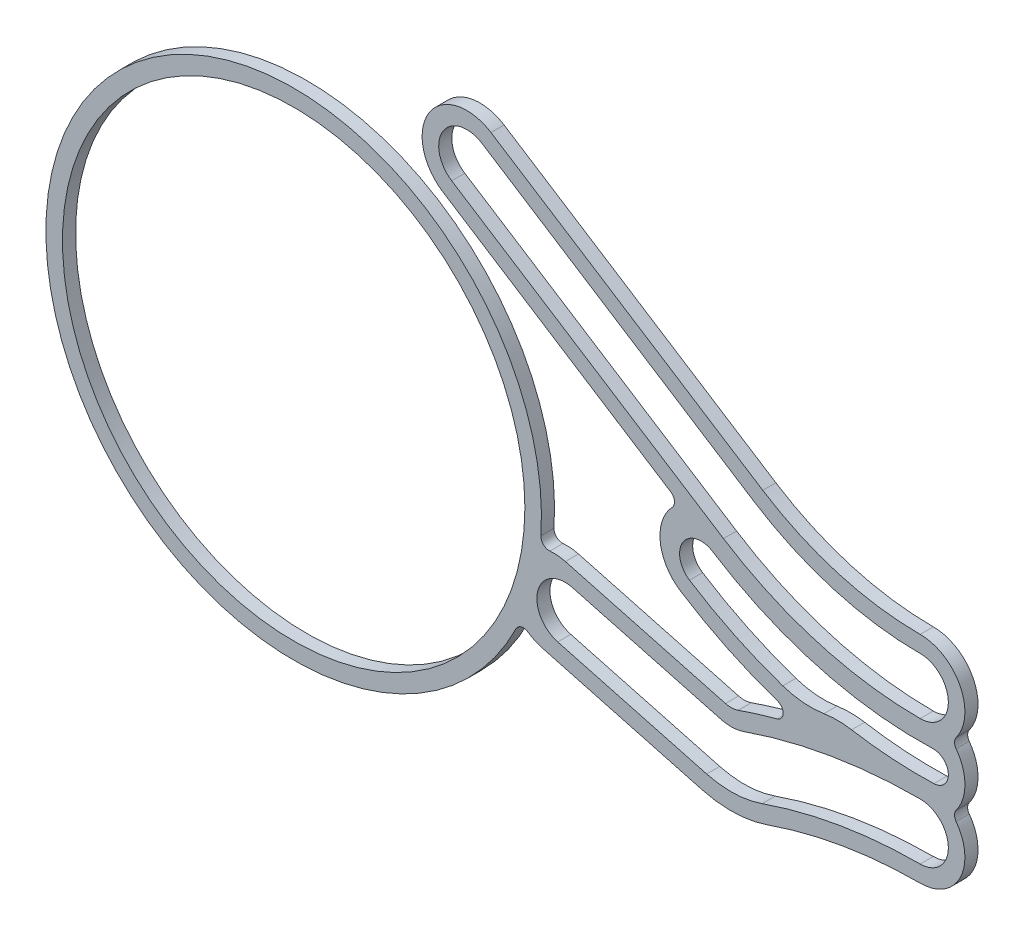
ISO-10303-21;
HEADER;
FILE_DESCRIPTION(('STEP AP214'),'2;1');
FILE_NAME('part.step','',(''),(''),'','','');
FILE_SCHEMA(('AUTOMOTIVE_DESIGN { 1 0 10303 214 1 1 1 1 }'));
ENDSEC;
DATA;
#1=APPLICATION_CONTEXT('core data for automotive mechanical design processes');
#2=APPLICATION_PROTOCOL_DEFINITION('international standard','automotive_design',2000,#1);
#3=PRODUCT_CONTEXT('',#1,'mechanical');
#4=PRODUCT('Part','Part','',(#3));
#5=PRODUCT_RELATED_PRODUCT_CATEGORY('part','',(#4));
#6=PRODUCT_DEFINITION_FORMATION('','',#4);
#7=PRODUCT_DEFINITION_CONTEXT('part definition',#1,'design');
#8=PRODUCT_DEFINITION('design','',#6,#7);
#9=PRODUCT_DEFINITION_SHAPE('','',#8);
#10=(LENGTH_UNIT() NAMED_UNIT(*) SI_UNIT(.MILLI.,.METRE.));
#11=(NAMED_UNIT(*) PLANE_ANGLE_UNIT() SI_UNIT($,.RADIAN.));
#12=(NAMED_UNIT(*) SI_UNIT($,.STERADIAN.) SOLID_ANGLE_UNIT());
#13=UNCERTAINTY_MEASURE_WITH_UNIT(LENGTH_MEASURE(1.E-05),#10,'distance_accuracy_value','');
#14=(GEOMETRIC_REPRESENTATION_CONTEXT(3) GLOBAL_UNCERTAINTY_ASSIGNED_CONTEXT((#13)) GLOBAL_UNIT_ASSIGNED_CONTEXT((#10,
#11,#12)) REPRESENTATION_CONTEXT('',''));
#15=CARTESIAN_POINT('',(0.,0.,0.));
#16=DIRECTION('',(0.,0.,1.));
#17=DIRECTION('',(1.,0.,0.));
#18=AXIS2_PLACEMENT_3D('',#15,#16,#17);
#19=CARTESIAN_POINT('',(44.5908291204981,-77.9302966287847,-1.79));
#20=DIRECTION('',(0.,0.,-1.));
#21=DIRECTION('',(-1.,0.,0.));
#22=AXIS2_PLACEMENT_3D('',#19,#20,#21);
#23=PLANE('',#22);
#24=CARTESIAN_POINT('',(56.7998899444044,-76.1867306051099,-1.79));
#25=DIRECTION('',(0.,0.,-1.));
#26=DIRECTION('',(-1.,0.,0.));
#27=AXIS2_PLACEMENT_3D('',#24,#25,#26);
#28=CIRCLE('',#27,0.899999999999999);
#29=CARTESIAN_POINT('',(56.7700379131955,-75.2872258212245,-1.79));
#30=VERTEX_POINT('',#29);
#31=CARTESIAN_POINT('',(56.8297419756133,-77.0862353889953,-1.79));
#32=VERTEX_POINT('',#31);
#33=EDGE_CURVE('E446',#30,#32,#28,.T.);
#34=ORIENTED_EDGE('',*,*,#33,.F.);
#35=CARTESIAN_POINT('',(56.,-52.0843562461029,-1.79));
#36=DIRECTION('',(0.,0.,1.));
#37=DIRECTION('',(-1.,0.,0.));
#38=AXIS2_PLACEMENT_3D('',#35,#36,#37);
#39=CIRCLE('',#38,23.2156437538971);
#40=CARTESIAN_POINT('',(43.4851622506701,-71.6379991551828,-1.79));
#41=VERTEX_POINT('',#40);
#42=EDGE_CURVE('E444',#41,#30,#39,.T.);
#43=ORIENTED_EDGE('',*,*,#42,.F.);
#44=CARTESIAN_POINT('',(42.7843723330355,-72.7329391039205,-1.79));
#45=DIRECTION('',(0.,0.,-1.));
#46=DIRECTION('',(1.,0.,0.));
#47=AXIS2_PLACEMENT_3D('',#44,#45,#46);
#48=CIRCLE('',#47,1.3);
#49=CARTESIAN_POINT('',(42.0835824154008,-73.8278790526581,-1.79));
#50=VERTEX_POINT('',#49);
#51=EDGE_CURVE('E458',#50,#41,#48,.T.);
#52=ORIENTED_EDGE('',*,*,#51,.F.);
#53=CARTESIAN_POINT('',(56.,-52.0843562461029,-1.79));
#54=DIRECTION('',(0.,0.,-1.));
#55=DIRECTION('',(-1.,0.,0.));
#56=AXIS2_PLACEMENT_3D('',#53,#54,#55);
#57=CIRCLE('',#56,25.8156437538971);
#58=CARTESIAN_POINT('',(47.7128413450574,-76.5337011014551,-1.79));
#59=VERTEX_POINT('',#58);
#60=EDGE_CURVE('E455',#59,#50,#57,.T.);
#61=ORIENTED_EDGE('',*,*,#60,.F.);
#62=CARTESIAN_POINT('',(49.3848851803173,-71.6007224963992,-1.79));
#63=DIRECTION('',(0.,0.,-1.));
#64=DIRECTION('',(1.,0.,0.));
#65=AXIS2_PLACEMENT_3D('',#62,#63,#64);
#66=CIRCLE('',#65,5.20864747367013);
#67=CARTESIAN_POINT('',(50.19220684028,-76.746423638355,-1.79));
#68=VERTEX_POINT('',#67);
#69=EDGE_CURVE('E453',#68,#59,#66,.T.);
#70=ORIENTED_EDGE('',*,*,#69,.F.);
#71=CARTESIAN_POINT('',(50.9995285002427,-81.8921247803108,-1.79));
#72=DIRECTION('',(0.,0.,1.));
#73=DIRECTION('',(-1.,0.,0.));
#74=AXIS2_PLACEMENT_3D('',#71,#72,#73);
#75=CIRCLE('',#74,5.20864747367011);
#76=CARTESIAN_POINT('',(51.8612755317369,-76.7552579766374,-1.79));
#77=VERTEX_POINT('',#76);
#78=EDGE_CURVE('E451',#77,#68,#75,.T.);
#79=ORIENTED_EDGE('',*,*,#78,.F.);
#80=CARTESIAN_POINT('',(56.,-52.0843562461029,-1.79));
#81=DIRECTION('',(0.,0.,-1.));
#82=DIRECTION('',(-1.,0.,0.));
#83=AXIS2_PLACEMENT_3D('',#80,#81,#82);
#84=CIRCLE('',#83,25.0156437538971);
#85=EDGE_CURVE('E449',#32,#77,#84,.T.);
#86=ORIENTED_EDGE('',*,*,#85,.F.);
#87=EDGE_LOOP('',(#34,#43,#52,#61,#70,#79,#86));
#88=FACE_BOUND('',#87,.T.);
#89=CARTESIAN_POINT('',(44.5908291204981,-77.9302966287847,-1.79));
#90=DIRECTION('',(0.,0.,1.));
#91=DIRECTION('',(-1.,0.,0.));
#92=AXIS2_PLACEMENT_3D('',#89,#90,#91);
#93=CIRCLE('',#92,1.30000000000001);
#94=CARTESIAN_POINT('',(44.2543643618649,-79.1860002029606,-1.79));
#95=VERTEX_POINT('',#94);
#96=CARTESIAN_POINT('',(45.0184770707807,-79.1579436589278,-1.79));
#97=VERTEX_POINT('',#96);
#98=EDGE_CURVE('E496',#95,#97,#93,.T.);
#99=ORIENTED_EDGE('',*,*,#98,.T.);
#100=CARTESIAN_POINT('',(56.,-110.682551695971,-1.79));
#101=DIRECTION('',(0.,0.,-1.));
#102=DIRECTION('',(-1.,0.,0.));
#103=AXIS2_PLACEMENT_3D('',#100,#101,#102);
#104=CIRCLE('',#103,33.3825516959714);
#105=CARTESIAN_POINT('',(47.3607199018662,-78.4372792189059,-1.79));
#106=VERTEX_POINT('',#105);
#107=EDGE_CURVE('E499',#97,#106,#104,.T.);
#108=ORIENTED_EDGE('',*,*,#107,.T.);
#109=CARTESIAN_POINT('',(47.2313217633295,-77.9543132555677,-1.79));
#110=DIRECTION('',(0.,0.,1.));
#111=DIRECTION('',(-1.,0.,0.));
#112=AXIS2_PLACEMENT_3D('',#109,#110,#111);
#113=CIRCLE('',#112,0.500000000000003);
#114=CARTESIAN_POINT('',(47.3918282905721,-77.4807758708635,-1.79));
#115=VERTEX_POINT('',#114);
#116=EDGE_CURVE('E502',#106,#115,#113,.T.);
#117=ORIENTED_EDGE('',*,*,#116,.T.);
#118=CARTESIAN_POINT('',(56.,-52.0843562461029,-1.79));
#119=DIRECTION('',(0.,0.,-1.));
#120=DIRECTION('',(-1.,0.,0.));
#121=AXIS2_PLACEMENT_3D('',#118,#119,#120);
#122=CIRCLE('',#121,26.8156437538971);
#123=CARTESIAN_POINT('',(41.5445132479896,-74.6701405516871,-1.79));
#124=VERTEX_POINT('',#123);
#125=EDGE_CURVE('E504',#115,#124,#122,.T.);
#126=ORIENTED_EDGE('',*,*,#125,.T.);
#127=CARTESIAN_POINT('',(43.,-72.3960345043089,-1.79));
#128=DIRECTION('',(0.,0.,-1.));
#129=DIRECTION('',(-1.,0.,0.));
#130=AXIS2_PLACEMENT_3D('',#127,#128,#129);
#131=CIRCLE('',#130,2.7);
#132=CARTESIAN_POINT('',(41.0391298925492,-70.5399665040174,-1.79));
#133=VERTEX_POINT('',#132);
#134=EDGE_CURVE('E506',#124,#133,#131,.T.);
#135=ORIENTED_EDGE('',*,*,#134,.T.);
#136=CARTESIAN_POINT('',(40.6760057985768,-70.1962502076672,-1.79));
#137=DIRECTION('',(0.,0.,1.));
#138=DIRECTION('',(-1.,0.,0.));
#139=AXIS2_PLACEMENT_3D('',#136,#137,#138);
#140=CIRCLE('',#139,0.500000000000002);
#141=CARTESIAN_POINT('',(40.9455403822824,-69.7751194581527,-1.79));
#142=VERTEX_POINT('',#141);
#143=EDGE_CURVE('E508',#133,#142,#140,.T.);
#144=ORIENTED_EDGE('',*,*,#143,.T.);
#145=DIRECTION('',(-0.842261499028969,0.539069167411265,0.));
#146=VECTOR('',#145,1.);
#147=CARTESIAN_POINT('',(40.9455403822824,-69.7751194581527,-1.79));
#148=LINE('',#147,#146);
#149=CARTESIAN_POINT('',(27.1945132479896,-60.9741060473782,-1.79));
#150=VERTEX_POINT('',#149);
#151=EDGE_CURVE('E510',#142,#150,#148,.T.);
#152=ORIENTED_EDGE('',*,*,#151,.T.);
#153=CARTESIAN_POINT('',(28.65,-58.7,-1.79));
#154=DIRECTION('',(0.,0.,-1.));
#155=DIRECTION('',(-1.,0.,0.));
#156=AXIS2_PLACEMENT_3D('',#153,#154,#155);
#157=CIRCLE('',#156,2.7);
#158=CARTESIAN_POINT('',(30.1054867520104,-56.4258939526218,-1.79));
#159=VERTEX_POINT('',#158);
#160=EDGE_CURVE('E512',#150,#159,#157,.T.);
#161=ORIENTED_EDGE('',*,*,#160,.T.);
#162=DIRECTION('',(0.842261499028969,-0.539069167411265,0.));
#163=VECTOR('',#162,1.);
#164=CARTESIAN_POINT('',(30.1054867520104,-56.4258939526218,-1.79));
#165=LINE('',#164,#163);
#166=CARTESIAN_POINT('',(46.5039495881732,-66.9213347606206,-1.79));
#167=VERTEX_POINT('',#166);
#168=EDGE_CURVE('E514',#159,#167,#165,.T.);
#169=ORIENTED_EDGE('',*,*,#168,.T.);
#170=CARTESIAN_POINT('',(56.,-52.0843562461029,-1.79));
#171=DIRECTION('',(0.,0.,1.));
#172=DIRECTION('',(-1.,0.,0.));
#173=AXIS2_PLACEMENT_3D('',#170,#171,#172);
#174=CIRCLE('',#173,17.6156437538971);
#175=CARTESIAN_POINT('',(56.,-69.7,-1.79));
#176=VERTEX_POINT('',#175);
#177=EDGE_CURVE('E516',#167,#176,#174,.T.);
#178=ORIENTED_EDGE('',*,*,#177,.T.);
#179=CARTESIAN_POINT('',(56.,-72.4,-1.79));
#180=DIRECTION('',(0.,0.,-1.));
#181=DIRECTION('',(-1.,0.,0.));
#182=AXIS2_PLACEMENT_3D('',#179,#180,#181);
#183=CIRCLE('',#182,2.7);
#184=CARTESIAN_POINT('',(58.1725538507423,-74.003125,-1.79));
#185=VERTEX_POINT('',#184);
#186=EDGE_CURVE('E518',#176,#185,#183,.T.);
#187=ORIENTED_EDGE('',*,*,#186,.T.);
#188=CARTESIAN_POINT('',(58.5748786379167,-74.3,-1.79));
#189=DIRECTION('',(0.,0.,1.));
#190=DIRECTION('',(-1.,0.,0.));
#191=AXIS2_PLACEMENT_3D('',#188,#189,#190);
#192=CIRCLE('',#191,0.499999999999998);
#193=CARTESIAN_POINT('',(58.1725538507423,-74.596875,-1.79));
#194=VERTEX_POINT('',#193);
#195=EDGE_CURVE('E520',#185,#194,#192,.T.);
#196=ORIENTED_EDGE('',*,*,#195,.T.);
#197=CARTESIAN_POINT('',(56.,-76.2,-1.79));
#198=DIRECTION('',(0.,0.,-1.));
#199=DIRECTION('',(-1.,0.,0.));
#200=AXIS2_PLACEMENT_3D('',#197,#198,#199);
#201=CIRCLE('',#200,2.70000000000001);
#202=CARTESIAN_POINT('',(58.1725538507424,-77.8031249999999,-1.79));
#203=VERTEX_POINT('',#202);
#204=EDGE_CURVE('E522',#194,#203,#201,.T.);
#205=ORIENTED_EDGE('',*,*,#204,.T.);
#206=CARTESIAN_POINT('',(58.5748786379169,-78.0999999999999,-1.79));
#207=DIRECTION('',(0.,0.,1.));
#208=DIRECTION('',(-1.,0.,0.));
#209=AXIS2_PLACEMENT_3D('',#206,#207,#208);
#210=CIRCLE('',#209,0.500000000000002);
#211=CARTESIAN_POINT('',(58.1725538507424,-78.3968749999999,-1.79));
#212=VERTEX_POINT('',#211);
#213=EDGE_CURVE('E524',#203,#212,#210,.T.);
#214=ORIENTED_EDGE('',*,*,#213,.T.);
#215=CARTESIAN_POINT('',(56.,-80.,-1.79));
#216=DIRECTION('',(0.,0.,-1.));
#217=DIRECTION('',(-1.,0.,0.));
#218=AXIS2_PLACEMENT_3D('',#215,#216,#217);
#219=CIRCLE('',#218,2.70000000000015);
#220=CARTESIAN_POINT('',(56.0000000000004,-82.7000000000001,-1.79));
#221=VERTEX_POINT('',#220);
#222=EDGE_CURVE('E526',#212,#221,#219,.T.);
#223=ORIENTED_EDGE('',*,*,#222,.T.);
#224=CARTESIAN_POINT('',(56.,-110.682551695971,-1.79));
#225=DIRECTION('',(0.,0.,1.));
#226=DIRECTION('',(-1.,0.,0.));
#227=AXIS2_PLACEMENT_3D('',#224,#225,#226);
#228=CIRCLE('',#227,27.9825516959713);
#229=CARTESIAN_POINT('',(46.7948608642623,-84.2574005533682,-1.79));
#230=VERTEX_POINT('',#229);
#231=EDGE_CURVE('E528',#221,#230,#228,.T.);
#232=ORIENTED_EDGE('',*,*,#231,.T.);
#233=CARTESIAN_POINT('',(44.5908291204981,-77.9302966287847,-1.79));
#234=DIRECTION('',(0.,0.,-1.));
#235=DIRECTION('',(-1.,0.,0.));
#236=AXIS2_PLACEMENT_3D('',#233,#234,#235);
#237=CIRCLE('',#236,6.70000000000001);
#238=CARTESIAN_POINT('',(42.8567415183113,-84.4019996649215,-1.79));
#239=VERTEX_POINT('',#238);
#240=EDGE_CURVE('E530',#230,#239,#237,.T.);
#241=ORIENTED_EDGE('',*,*,#240,.T.);
#242=DIRECTION('',(-0.965925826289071,0.258819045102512,0.));
#243=VECTOR('',#242,1.);
#244=CARTESIAN_POINT('',(42.8567415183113,-84.4019996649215,-1.79));
#245=LINE('',#244,#243);
#246=CARTESIAN_POINT('',(33.1974832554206,-81.8138092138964,-1.79));
#247=VERTEX_POINT('',#246);
#248=EDGE_CURVE('E532',#239,#247,#245,.T.);
#249=ORIENTED_EDGE('',*,*,#248,.T.);
#250=CARTESIAN_POINT('',(33.8962946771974,-79.2058094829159,-1.79));
#251=DIRECTION('',(0.,0.,-1.));
#252=DIRECTION('',(-1.,0.,0.));
#253=AXIS2_PLACEMENT_3D('',#250,#251,#252);
#254=CIRCLE('',#253,2.69999999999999);
#255=CARTESIAN_POINT('',(32.3469615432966,-81.4170459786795,-1.79));
#256=VERTEX_POINT('',#255);
#257=EDGE_CURVE('E534',#247,#256,#254,.T.);
#258=ORIENTED_EDGE('',*,*,#257,.T.);
#259=CARTESIAN_POINT('',(32.0600479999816,-81.8265342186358,-1.79));
#260=DIRECTION('',(0.,0.,1.));
#261=DIRECTION('',(-1.,0.,0.));
#262=AXIS2_PLACEMENT_3D('',#259,#260,#261);
#263=CIRCLE('',#262,0.499999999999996);
#264=CARTESIAN_POINT('',(31.6115027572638,-81.6056107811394,-1.79));
#265=VERTEX_POINT('',#264);
#266=EDGE_CURVE('E536',#256,#265,#263,.T.);
#267=ORIENTED_EDGE('',*,*,#266,.T.);
#268=CARTESIAN_POINT('',(18.2,-75.,-1.79));
#269=DIRECTION('',(0.,0.,-1.));
#270=DIRECTION('',(-1.,0.,0.));
#271=AXIS2_PLACEMENT_3D('',#268,#269,#270);
#272=CIRCLE('',#271,14.95);
#273=CARTESIAN_POINT('',(33.1175074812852,-75.9851246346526,-1.79));
#274=VERTEX_POINT('',#273);
#275=EDGE_CURVE('E538',#265,#274,#272,.T.);
#276=ORIENTED_EDGE('',*,*,#275,.T.);
#277=CARTESIAN_POINT('',(33.6164207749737,-76.0180719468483,-1.79));
#278=DIRECTION('',(0.,0.,1.));
#279=DIRECTION('',(-1.,0.,0.));
#280=AXIS2_PLACEMENT_3D('',#277,#278,#279);
#281=CIRCLE('',#280,0.499999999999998);
#282=CARTESIAN_POINT('',(33.6601510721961,-76.5161559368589,-1.79));
#283=VERTEX_POINT('',#282);
#284=EDGE_CURVE('E540',#274,#283,#281,.T.);
#285=ORIENTED_EDGE('',*,*,#284,.T.);
#286=CARTESIAN_POINT('',(33.8962946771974,-79.2058094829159,-1.79));
#287=DIRECTION('',(0.,0.,-1.));
#288=DIRECTION('',(-1.,0.,0.));
#289=AXIS2_PLACEMENT_3D('',#286,#287,#288);
#290=CIRCLE('',#289,2.70000000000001);
#291=CARTESIAN_POINT('',(34.5951060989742,-76.5978097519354,-1.79));
#292=VERTEX_POINT('',#291);
#293=EDGE_CURVE('E542',#283,#292,#290,.T.);
#294=ORIENTED_EDGE('',*,*,#293,.T.);
#295=DIRECTION('',(0.965925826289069,-0.258819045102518,0.));
#296=VECTOR('',#295,1.);
#297=CARTESIAN_POINT('',(34.5951060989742,-76.5978097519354,-1.79));
#298=LINE('',#297,#296);
#299=EDGE_CURVE('E544',#292,#95,#298,.T.);
#300=ORIENTED_EDGE('',*,*,#299,.T.);
#301=EDGE_LOOP('',(#99,#108,#117,#126,#135,#144,#152,#161,#169,#178,#187,#196,#205,#214,#223,
#232,#241,#249,#258,#267,#276,#285,#294,#300));
#302=FACE_BOUND('',#301,.T.);
#303=CARTESIAN_POINT('',(18.2,-75.,-1.79));
#304=DIRECTION('',(0.,0.,-1.));
#305=DIRECTION('',(-1.,0.,0.));
#306=AXIS2_PLACEMENT_3D('',#303,#304,#305);
#307=CIRCLE('',#306,13.95);
#308=CARTESIAN_POINT('',(32.15,-75.,-1.79));
#309=VERTEX_POINT('',#308);
#310=EDGE_CURVE('E438',#309,#309,#307,.T.);
#311=ORIENTED_EDGE('',*,*,#310,.F.);
#312=EDGE_LOOP('',(#311));
#313=FACE_BOUND('',#312,.T.);
#314=CARTESIAN_POINT('',(56.0000000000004,-80.,-1.79));
#315=DIRECTION('',(0.,0.,-1.));
#316=DIRECTION('',(-1.,0.,0.));
#317=AXIS2_PLACEMENT_3D('',#314,#315,#316);
#318=CIRCLE('',#317,1.70000000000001);
#319=CARTESIAN_POINT('',(56.,-78.3,-1.79));
#320=VERTEX_POINT('',#319);
#321=CARTESIAN_POINT('',(56.0000000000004,-81.7,-1.79));
#322=VERTEX_POINT('',#321);
#323=EDGE_CURVE('E381',#320,#322,#318,.T.);
#324=ORIENTED_EDGE('',*,*,#323,.F.);
#325=CARTESIAN_POINT('',(56.,-110.682551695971,-1.79));
#326=DIRECTION('',(0.,0.,-1.));
#327=DIRECTION('',(-1.,0.,0.));
#328=AXIS2_PLACEMENT_3D('',#325,#326,#327);
#329=CIRCLE('',#328,32.3825516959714);
#330=CARTESIAN_POINT('',(45.3474370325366,-80.1022875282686,-1.79));
#331=VERTEX_POINT('',#330);
#332=EDGE_CURVE('E379',#331,#320,#329,.T.);
#333=ORIENTED_EDGE('',*,*,#332,.F.);
#334=CARTESIAN_POINT('',(44.5908291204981,-77.9302966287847,-1.79));
#335=DIRECTION('',(0.,0.,1.));
#336=DIRECTION('',(-1.,0.,0.));
#337=AXIS2_PLACEMENT_3D('',#334,#335,#336);
#338=CIRCLE('',#337,2.29999999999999);
#339=CARTESIAN_POINT('',(43.9955453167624,-80.1519260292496,-1.79));
#340=VERTEX_POINT('',#339);
#341=EDGE_CURVE('E395',#340,#331,#338,.T.);
#342=ORIENTED_EDGE('',*,*,#341,.F.);
#343=DIRECTION('',(0.96592582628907,-0.258819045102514,0.));
#344=VECTOR('',#343,1.);
#345=CARTESIAN_POINT('',(35.012435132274,-77.7449089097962,-1.79));
#346=LINE('',#345,#344);
#347=CARTESIAN_POINT('',(35.012435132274,-77.7449089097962,-1.79));
#348=VERTEX_POINT('',#347);
#349=EDGE_CURVE('E392',#348,#340,#346,.T.);
#350=ORIENTED_EDGE('',*,*,#349,.F.);
#351=CARTESIAN_POINT('',(34.5724427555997,-79.3869828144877,-1.79));
#352=DIRECTION('',(0.,0.,-1.));
#353=DIRECTION('',(1.,0.,0.));
#354=AXIS2_PLACEMENT_3D('',#351,#352,#353);
#355=CIRCLE('',#354,1.69999999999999);
#356=CARTESIAN_POINT('',(34.1324503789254,-81.0290567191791,-1.79));
#357=VERTEX_POINT('',#356);
#358=EDGE_CURVE('E390',#357,#348,#355,.T.);
#359=ORIENTED_EDGE('',*,*,#358,.F.);
#360=DIRECTION('',(-0.96592582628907,0.258819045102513,0.));
#361=VECTOR('',#360,1.);
#362=CARTESIAN_POINT('',(43.1155605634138,-83.4360738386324,-1.79));
#363=LINE('',#362,#361);
#364=CARTESIAN_POINT('',(43.1155605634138,-83.4360738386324,-1.79));
#365=VERTEX_POINT('',#364);
#366=EDGE_CURVE('E388',#365,#357,#363,.T.);
#367=ORIENTED_EDGE('',*,*,#366,.F.);
#368=CARTESIAN_POINT('',(44.5908291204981,-77.9302966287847,-1.79));
#369=DIRECTION('',(0.,0.,-1.));
#370=DIRECTION('',(-1.,0.,0.));
#371=AXIS2_PLACEMENT_3D('',#368,#369,#370);
#372=CIRCLE('',#371,5.69999999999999);
#373=CARTESIAN_POINT('',(46.4659009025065,-83.3130566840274,-1.79));
#374=VERTEX_POINT('',#373);
#375=EDGE_CURVE('E386',#374,#365,#372,.T.);
#376=ORIENTED_EDGE('',*,*,#375,.F.);
#377=CARTESIAN_POINT('',(56.,-110.682551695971,-1.79));
#378=DIRECTION('',(0.,0.,1.));
#379=DIRECTION('',(-1.,0.,0.));
#380=AXIS2_PLACEMENT_3D('',#377,#378,#379);
#381=CIRCLE('',#380,28.9825516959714);
#382=EDGE_CURVE('E384',#322,#374,#381,.T.);
#383=ORIENTED_EDGE('',*,*,#382,.F.);
#384=EDGE_LOOP('',(#324,#333,#342,#350,#359,#367,#376,#383));
#385=FACE_BOUND('',#384,.T.);
#386=CARTESIAN_POINT('',(56.,-52.0843562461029,-1.79));
#387=DIRECTION('',(0.,0.,-1.));
#388=DIRECTION('',(-1.,0.,0.));
#389=AXIS2_PLACEMENT_3D('',#386,#387,#388);
#390=CIRCLE('',#389,22.0156437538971);
#391=CARTESIAN_POINT('',(56.,-74.1,-1.79));
#392=VERTEX_POINT('',#391);
#393=CARTESIAN_POINT('',(44.1320452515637,-70.627285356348,-1.79));
#394=VERTEX_POINT('',#393);
#395=EDGE_CURVE('E336',#392,#394,#390,.T.);
#396=ORIENTED_EDGE('',*,*,#395,.F.);
#397=CARTESIAN_POINT('',(56.,-72.4,-1.79));
#398=DIRECTION('',(0.,0.,-1.));
#399=DIRECTION('',(-1.,0.,0.));
#400=AXIS2_PLACEMENT_3D('',#397,#398,#399);
#401=CIRCLE('',#400,1.70000000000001);
#402=CARTESIAN_POINT('',(56.,-70.7,-1.79));
#403=VERTEX_POINT('',#402);
#404=EDGE_CURVE('E328',#403,#392,#401,.T.);
#405=ORIENTED_EDGE('',*,*,#404,.F.);
#406=CARTESIAN_POINT('',(56.,-52.0843562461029,-1.79));
#407=DIRECTION('',(0.,0.,1.));
#408=DIRECTION('',(-1.,0.,0.));
#409=AXIS2_PLACEMENT_3D('',#406,#407,#408);
#410=CIRCLE('',#409,18.6156437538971);
#411=CARTESIAN_POINT('',(45.964880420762,-67.7635962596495,-1.79));
#412=VERTEX_POINT('',#411);
#413=EDGE_CURVE('E357',#412,#403,#410,.T.);
#414=ORIENTED_EDGE('',*,*,#413,.F.);
#415=DIRECTION('',(0.842261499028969,-0.539069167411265,0.));
#416=VECTOR('',#415,1.);
#417=CARTESIAN_POINT('',(29.5664175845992,-57.2681554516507,-1.79));
#418=LINE('',#417,#416);
#419=CARTESIAN_POINT('',(29.5664175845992,-57.2681554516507,-1.79));
#420=VERTEX_POINT('',#419);
#421=EDGE_CURVE('E355',#420,#412,#418,.T.);
#422=ORIENTED_EDGE('',*,*,#421,.F.);
#423=CARTESIAN_POINT('',(28.65,-58.7,-1.79));
#424=DIRECTION('',(0.,0.,-1.));
#425=DIRECTION('',(-1.,0.,0.));
#426=AXIS2_PLACEMENT_3D('',#423,#424,#425);
#427=CIRCLE('',#426,1.7);
#428=CARTESIAN_POINT('',(27.7335824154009,-60.1318445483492,-1.79));
#429=VERTEX_POINT('',#428);
#430=EDGE_CURVE('E351',#429,#420,#427,.T.);
#431=ORIENTED_EDGE('',*,*,#430,.F.);
#432=DIRECTION('',(-0.842261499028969,0.539069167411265,0.));
#433=VECTOR('',#432,1.);
#434=CARTESIAN_POINT('',(44.1320452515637,-70.627285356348,-1.79));
#435=LINE('',#434,#433);
#436=EDGE_CURVE('E349',#394,#429,#435,.T.);
#437=ORIENTED_EDGE('',*,*,#436,.F.);
#438=EDGE_LOOP('',(#396,#405,#414,#422,#431,#437));
#439=FACE_BOUND('',#438,.T.);
#440=ADVANCED_FACE('F41',(#88,#302,#313,#385,#439),#23,.T.);
#441=CARTESIAN_POINT('',(44.5908291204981,-77.9302966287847,-1.));
#442=DIRECTION('',(0.,0.,-1.));
#443=DIRECTION('',(-1.,0.,0.));
#444=AXIS2_PLACEMENT_3D('',#441,#442,#443);
#445=PLANE('',#444);
#446=CARTESIAN_POINT('',(56.,-110.682551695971,-1.));
#447=DIRECTION('',(0.,0.,-1.));
#448=DIRECTION('',(-1.,0.,0.));
#449=AXIS2_PLACEMENT_3D('',#446,#447,#448);
#450=CIRCLE('',#449,32.3825516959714);
#451=CARTESIAN_POINT('',(45.3474370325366,-80.1022875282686,-1.));
#452=VERTEX_POINT('',#451);
#453=CARTESIAN_POINT('',(56.,-78.3,-1.));
#454=VERTEX_POINT('',#453);
#455=EDGE_CURVE('E344',#452,#454,#450,.T.);
#456=ORIENTED_EDGE('',*,*,#455,.T.);
#457=CARTESIAN_POINT('',(56.0000000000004,-80.,-1.));
#458=DIRECTION('',(0.,0.,-1.));
#459=DIRECTION('',(-1.,0.,0.));
#460=AXIS2_PLACEMENT_3D('',#457,#458,#459);
#461=CIRCLE('',#460,1.70000000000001);
#462=CARTESIAN_POINT('',(56.0000000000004,-81.7,-1.));
#463=VERTEX_POINT('',#462);
#464=EDGE_CURVE('E400',#454,#463,#461,.T.);
#465=ORIENTED_EDGE('',*,*,#464,.T.);
#466=CARTESIAN_POINT('',(56.,-110.682551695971,-1.));
#467=DIRECTION('',(0.,0.,1.));
#468=DIRECTION('',(-1.,0.,0.));
#469=AXIS2_PLACEMENT_3D('',#466,#467,#468);
#470=CIRCLE('',#469,28.9825516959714);
#471=CARTESIAN_POINT('',(46.4659009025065,-83.3130566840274,-1.));
#472=VERTEX_POINT('',#471);
#473=EDGE_CURVE('E403',#463,#472,#470,.T.);
#474=ORIENTED_EDGE('',*,*,#473,.T.);
#475=CARTESIAN_POINT('',(44.5908291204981,-77.9302966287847,-1.));
#476=DIRECTION('',(0.,0.,-1.));
#477=DIRECTION('',(-1.,0.,0.));
#478=AXIS2_PLACEMENT_3D('',#475,#476,#477);
#479=CIRCLE('',#478,5.69999999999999);
#480=CARTESIAN_POINT('',(43.1155605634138,-83.4360738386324,-1.));
#481=VERTEX_POINT('',#480);
#482=EDGE_CURVE('E406',#472,#481,#479,.T.);
#483=ORIENTED_EDGE('',*,*,#482,.T.);
#484=DIRECTION('',(-0.96592582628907,0.258819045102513,0.));
#485=VECTOR('',#484,1.);
#486=CARTESIAN_POINT('',(43.1155605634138,-83.4360738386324,-1.));
#487=LINE('',#486,#485);
#488=CARTESIAN_POINT('',(34.1324503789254,-81.0290567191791,-1.));
#489=VERTEX_POINT('',#488);
#490=EDGE_CURVE('E409',#481,#489,#487,.T.);
#491=ORIENTED_EDGE('',*,*,#490,.T.);
#492=CARTESIAN_POINT('',(34.5724427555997,-79.3869828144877,-1.));
#493=DIRECTION('',(0.,0.,-1.));
#494=DIRECTION('',(1.,0.,0.));
#495=AXIS2_PLACEMENT_3D('',#492,#493,#494);
#496=CIRCLE('',#495,1.69999999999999);
#497=CARTESIAN_POINT('',(35.012435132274,-77.7449089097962,-1.));
#498=VERTEX_POINT('',#497);
#499=EDGE_CURVE('E412',#489,#498,#496,.T.);
#500=ORIENTED_EDGE('',*,*,#499,.T.);
#501=DIRECTION('',(0.96592582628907,-0.258819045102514,0.));
#502=VECTOR('',#501,1.);
#503=CARTESIAN_POINT('',(35.012435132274,-77.7449089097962,-1.));
#504=LINE('',#503,#502);
#505=CARTESIAN_POINT('',(43.9955453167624,-80.1519260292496,-1.));
#506=VERTEX_POINT('',#505);
#507=EDGE_CURVE('E415',#498,#506,#504,.T.);
#508=ORIENTED_EDGE('',*,*,#507,.T.);
#509=CARTESIAN_POINT('',(44.5908291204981,-77.9302966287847,-1.));
#510=DIRECTION('',(0.,0.,1.));
#511=DIRECTION('',(-1.,0.,0.));
#512=AXIS2_PLACEMENT_3D('',#509,#510,#511);
#513=CIRCLE('',#512,2.29999999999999);
#514=EDGE_CURVE('E382',#506,#452,#513,.T.);
#515=ORIENTED_EDGE('',*,*,#514,.T.);
#516=EDGE_LOOP('',(#456,#465,#474,#483,#491,#500,#508,#515));
#517=FACE_BOUND('',#516,.T.);
#518=CARTESIAN_POINT('',(44.5908291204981,-77.9302966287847,-1.));
#519=DIRECTION('',(0.,0.,1.));
#520=DIRECTION('',(-1.,0.,0.));
#521=AXIS2_PLACEMENT_3D('',#518,#519,#520);
#522=CIRCLE('',#521,1.30000000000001);
#523=CARTESIAN_POINT('',(44.2543643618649,-79.1860002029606,-1.));
#524=VERTEX_POINT('',#523);
#525=CARTESIAN_POINT('',(45.0184770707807,-79.1579436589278,-1.));
#526=VERTEX_POINT('',#525);
#527=EDGE_CURVE('E495',#524,#526,#522,.T.);
#528=ORIENTED_EDGE('',*,*,#527,.F.);
#529=DIRECTION('',(0.965925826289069,-0.258819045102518,0.));
#530=VECTOR('',#529,1.);
#531=CARTESIAN_POINT('',(34.5951060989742,-76.5978097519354,-1.));
#532=LINE('',#531,#530);
#533=CARTESIAN_POINT('',(34.5951060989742,-76.5978097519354,-1.));
#534=VERTEX_POINT('',#533);
#535=EDGE_CURVE('E500',#534,#524,#532,.T.);
#536=ORIENTED_EDGE('',*,*,#535,.F.);
#537=CARTESIAN_POINT('',(33.8962946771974,-79.2058094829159,-1.));
#538=DIRECTION('',(0.,0.,-1.));
#539=DIRECTION('',(-1.,0.,0.));
#540=AXIS2_PLACEMENT_3D('',#537,#538,#539);
#541=CIRCLE('',#540,2.70000000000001);
#542=CARTESIAN_POINT('',(33.6601510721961,-76.5161559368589,-1.));
#543=VERTEX_POINT('',#542);
#544=EDGE_CURVE('E591',#543,#534,#541,.T.);
#545=ORIENTED_EDGE('',*,*,#544,.F.);
#546=CARTESIAN_POINT('',(33.6164207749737,-76.0180719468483,-1.));
#547=DIRECTION('',(0.,0.,1.));
#548=DIRECTION('',(-1.,0.,0.));
#549=AXIS2_PLACEMENT_3D('',#546,#547,#548);
#550=CIRCLE('',#549,0.499999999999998);
#551=CARTESIAN_POINT('',(33.1175074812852,-75.9851246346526,-1.));
#552=VERTEX_POINT('',#551);
#553=EDGE_CURVE('E589',#552,#543,#550,.T.);
#554=ORIENTED_EDGE('',*,*,#553,.F.);
#555=CARTESIAN_POINT('',(18.2,-75.,-1.));
#556=DIRECTION('',(0.,0.,-1.));
#557=DIRECTION('',(-1.,0.,0.));
#558=AXIS2_PLACEMENT_3D('',#555,#556,#557);
#559=CIRCLE('',#558,14.95);
#560=CARTESIAN_POINT('',(31.6115027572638,-81.6056107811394,-1.));
#561=VERTEX_POINT('',#560);
#562=EDGE_CURVE('E587',#561,#552,#559,.T.);
#563=ORIENTED_EDGE('',*,*,#562,.F.);
#564=CARTESIAN_POINT('',(32.0600479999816,-81.8265342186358,-1.));
#565=DIRECTION('',(0.,0.,1.));
#566=DIRECTION('',(-1.,0.,0.));
#567=AXIS2_PLACEMENT_3D('',#564,#565,#566);
#568=CIRCLE('',#567,0.499999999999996);
#569=CARTESIAN_POINT('',(32.3469615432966,-81.4170459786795,-1.));
#570=VERTEX_POINT('',#569);
#571=EDGE_CURVE('E585',#570,#561,#568,.T.);
#572=ORIENTED_EDGE('',*,*,#571,.F.);
#573=CARTESIAN_POINT('',(33.8962946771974,-79.2058094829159,-1.));
#574=DIRECTION('',(0.,0.,-1.));
#575=DIRECTION('',(-1.,0.,0.));
#576=AXIS2_PLACEMENT_3D('',#573,#574,#575);
#577=CIRCLE('',#576,2.69999999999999);
#578=CARTESIAN_POINT('',(33.1974832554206,-81.8138092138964,-1.));
#579=VERTEX_POINT('',#578);
#580=EDGE_CURVE('E583',#579,#570,#577,.T.);
#581=ORIENTED_EDGE('',*,*,#580,.F.);
#582=DIRECTION('',(-0.965925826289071,0.258819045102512,0.));
#583=VECTOR('',#582,1.);
#584=CARTESIAN_POINT('',(42.8567415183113,-84.4019996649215,-1.));
#585=LINE('',#584,#583);
#586=CARTESIAN_POINT('',(42.8567415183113,-84.4019996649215,-1.));
#587=VERTEX_POINT('',#586);
#588=EDGE_CURVE('E581',#587,#579,#585,.T.);
#589=ORIENTED_EDGE('',*,*,#588,.F.);
#590=CARTESIAN_POINT('',(44.5908291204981,-77.9302966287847,-1.));
#591=DIRECTION('',(0.,0.,-1.));
#592=DIRECTION('',(-1.,0.,0.));
#593=AXIS2_PLACEMENT_3D('',#590,#591,#592);
#594=CIRCLE('',#593,6.70000000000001);
#595=CARTESIAN_POINT('',(46.7948608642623,-84.2574005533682,-1.));
#596=VERTEX_POINT('',#595);
#597=EDGE_CURVE('E579',#596,#587,#594,.T.);
#598=ORIENTED_EDGE('',*,*,#597,.F.);
#599=CARTESIAN_POINT('',(56.,-110.682551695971,-1.));
#600=DIRECTION('',(0.,0.,1.));
#601=DIRECTION('',(-1.,0.,0.));
#602=AXIS2_PLACEMENT_3D('',#599,#600,#601);
#603=CIRCLE('',#602,27.9825516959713);
#604=CARTESIAN_POINT('',(56.0000000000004,-82.7000000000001,-1.));
#605=VERTEX_POINT('',#604);
#606=EDGE_CURVE('E577',#605,#596,#603,.T.);
#607=ORIENTED_EDGE('',*,*,#606,.F.);
#608=CARTESIAN_POINT('',(56.,-80.,-1.));
#609=DIRECTION('',(0.,0.,-1.));
#610=DIRECTION('',(-1.,0.,0.));
#611=AXIS2_PLACEMENT_3D('',#608,#609,#610);
#612=CIRCLE('',#611,2.70000000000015);
#613=CARTESIAN_POINT('',(58.1725538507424,-78.3968749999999,-1.));
#614=VERTEX_POINT('',#613);
#615=EDGE_CURVE('E575',#614,#605,#612,.T.);
#616=ORIENTED_EDGE('',*,*,#615,.F.);
#617=CARTESIAN_POINT('',(58.5748786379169,-78.0999999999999,-1.));
#618=DIRECTION('',(0.,0.,1.));
#619=DIRECTION('',(-1.,0.,0.));
#620=AXIS2_PLACEMENT_3D('',#617,#618,#619);
#621=CIRCLE('',#620,0.500000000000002);
#622=CARTESIAN_POINT('',(58.1725538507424,-77.8031249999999,-1.));
#623=VERTEX_POINT('',#622);
#624=EDGE_CURVE('E573',#623,#614,#621,.T.);
#625=ORIENTED_EDGE('',*,*,#624,.F.);
#626=CARTESIAN_POINT('',(56.,-76.2,-1.));
#627=DIRECTION('',(0.,0.,-1.));
#628=DIRECTION('',(-1.,0.,0.));
#629=AXIS2_PLACEMENT_3D('',#626,#627,#628);
#630=CIRCLE('',#629,2.70000000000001);
#631=CARTESIAN_POINT('',(58.1725538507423,-74.596875,-1.));
#632=VERTEX_POINT('',#631);
#633=EDGE_CURVE('E571',#632,#623,#630,.T.);
#634=ORIENTED_EDGE('',*,*,#633,.F.);
#635=CARTESIAN_POINT('',(58.5748786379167,-74.3,-1.));
#636=DIRECTION('',(0.,0.,1.));
#637=DIRECTION('',(-1.,0.,0.));
#638=AXIS2_PLACEMENT_3D('',#635,#636,#637);
#639=CIRCLE('',#638,0.499999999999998);
#640=CARTESIAN_POINT('',(58.1725538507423,-74.003125,-1.));
#641=VERTEX_POINT('',#640);
#642=EDGE_CURVE('E569',#641,#632,#639,.T.);
#643=ORIENTED_EDGE('',*,*,#642,.F.);
#644=CARTESIAN_POINT('',(56.,-72.4,-1.));
#645=DIRECTION('',(0.,0.,-1.));
#646=DIRECTION('',(-1.,0.,0.));
#647=AXIS2_PLACEMENT_3D('',#644,#645,#646);
#648=CIRCLE('',#647,2.7);
#649=CARTESIAN_POINT('',(56.,-69.7,-1.));
#650=VERTEX_POINT('',#649);
#651=EDGE_CURVE('E567',#650,#641,#648,.T.);
#652=ORIENTED_EDGE('',*,*,#651,.F.);
#653=CARTESIAN_POINT('',(56.,-52.0843562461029,-1.));
#654=DIRECTION('',(0.,0.,1.));
#655=DIRECTION('',(-1.,0.,0.));
#656=AXIS2_PLACEMENT_3D('',#653,#654,#655);
#657=CIRCLE('',#656,17.6156437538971);
#658=CARTESIAN_POINT('',(46.5039495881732,-66.9213347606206,-1.));
#659=VERTEX_POINT('',#658);
#660=EDGE_CURVE('E565',#659,#650,#657,.T.);
#661=ORIENTED_EDGE('',*,*,#660,.F.);
#662=DIRECTION('',(0.842261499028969,-0.539069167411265,0.));
#663=VECTOR('',#662,1.);
#664=CARTESIAN_POINT('',(30.1054867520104,-56.4258939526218,-1.));
#665=LINE('',#664,#663);
#666=CARTESIAN_POINT('',(30.1054867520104,-56.4258939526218,-1.));
#667=VERTEX_POINT('',#666);
#668=EDGE_CURVE('E563',#667,#659,#665,.T.);
#669=ORIENTED_EDGE('',*,*,#668,.F.);
#670=CARTESIAN_POINT('',(28.65,-58.7,-1.));
#671=DIRECTION('',(0.,0.,-1.));
#672=DIRECTION('',(-1.,0.,0.));
#673=AXIS2_PLACEMENT_3D('',#670,#671,#672);
#674=CIRCLE('',#673,2.7);
#675=CARTESIAN_POINT('',(27.1945132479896,-60.9741060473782,-1.));
#676=VERTEX_POINT('',#675);
#677=EDGE_CURVE('E561',#676,#667,#674,.T.);
#678=ORIENTED_EDGE('',*,*,#677,.F.);
#679=DIRECTION('',(-0.842261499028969,0.539069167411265,0.));
#680=VECTOR('',#679,1.);
#681=CARTESIAN_POINT('',(40.9455403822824,-69.7751194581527,-1.));
#682=LINE('',#681,#680);
#683=CARTESIAN_POINT('',(40.9455403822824,-69.7751194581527,-1.));
#684=VERTEX_POINT('',#683);
#685=EDGE_CURVE('E559',#684,#676,#682,.T.);
#686=ORIENTED_EDGE('',*,*,#685,.F.);
#687=CARTESIAN_POINT('',(40.6760057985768,-70.1962502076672,-1.));
#688=DIRECTION('',(0.,0.,1.));
#689=DIRECTION('',(-1.,0.,0.));
#690=AXIS2_PLACEMENT_3D('',#687,#688,#689);
#691=CIRCLE('',#690,0.500000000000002);
#692=CARTESIAN_POINT('',(41.0391298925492,-70.5399665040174,-1.));
#693=VERTEX_POINT('',#692);
#694=EDGE_CURVE('E557',#693,#684,#691,.T.);
#695=ORIENTED_EDGE('',*,*,#694,.F.);
#696=CARTESIAN_POINT('',(43.,-72.3960345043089,-1.));
#697=DIRECTION('',(0.,0.,-1.));
#698=DIRECTION('',(-1.,0.,0.));
#699=AXIS2_PLACEMENT_3D('',#696,#697,#698);
#700=CIRCLE('',#699,2.7);
#701=CARTESIAN_POINT('',(41.5445132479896,-74.6701405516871,-1.));
#702=VERTEX_POINT('',#701);
#703=EDGE_CURVE('E555',#702,#693,#700,.T.);
#704=ORIENTED_EDGE('',*,*,#703,.F.);
#705=CARTESIAN_POINT('',(56.,-52.0843562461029,-1.));
#706=DIRECTION('',(0.,0.,-1.));
#707=DIRECTION('',(-1.,0.,0.));
#708=AXIS2_PLACEMENT_3D('',#705,#706,#707);
#709=CIRCLE('',#708,26.8156437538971);
#710=CARTESIAN_POINT('',(47.3918282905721,-77.4807758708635,-1.));
#711=VERTEX_POINT('',#710);
#712=EDGE_CURVE('E553',#711,#702,#709,.T.);
#713=ORIENTED_EDGE('',*,*,#712,.F.);
#714=CARTESIAN_POINT('',(47.2313217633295,-77.9543132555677,-1.));
#715=DIRECTION('',(0.,0.,1.));
#716=DIRECTION('',(-1.,0.,0.));
#717=AXIS2_PLACEMENT_3D('',#714,#715,#716);
#718=CIRCLE('',#717,0.500000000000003);
#719=CARTESIAN_POINT('',(47.3607199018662,-78.4372792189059,-1.));
#720=VERTEX_POINT('',#719);
#721=EDGE_CURVE('E551',#720,#711,#718,.T.);
#722=ORIENTED_EDGE('',*,*,#721,.F.);
#723=CARTESIAN_POINT('',(56.,-110.682551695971,-1.));
#724=DIRECTION('',(0.,0.,-1.));
#725=DIRECTION('',(-1.,0.,0.));
#726=AXIS2_PLACEMENT_3D('',#723,#724,#725);
#727=CIRCLE('',#726,33.3825516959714);
#728=EDGE_CURVE('E549',#526,#720,#727,.T.);
#729=ORIENTED_EDGE('',*,*,#728,.F.);
#730=EDGE_LOOP('',(#528,#536,#545,#554,#563,#572,#581,#589,#598,#607,#616,#625,#634,#643,#652,
#661,#669,#678,#686,#695,#704,#713,#722,#729));
#731=FACE_BOUND('',#730,.T.);
#732=CARTESIAN_POINT('',(56.,-52.0843562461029,-1.));
#733=DIRECTION('',(0.,0.,1.));
#734=DIRECTION('',(-1.,0.,0.));
#735=AXIS2_PLACEMENT_3D('',#732,#733,#734);
#736=CIRCLE('',#735,23.2156437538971);
#737=CARTESIAN_POINT('',(43.4851622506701,-71.6379991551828,-1.));
#738=VERTEX_POINT('',#737);
#739=CARTESIAN_POINT('',(56.7700379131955,-75.2872258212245,-1.));
#740=VERTEX_POINT('',#739);
#741=EDGE_CURVE('E441',#738,#740,#736,.T.);
#742=ORIENTED_EDGE('',*,*,#741,.T.);
#743=CARTESIAN_POINT('',(56.7998899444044,-76.1867306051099,-1.));
#744=DIRECTION('',(0.,0.,-1.));
#745=DIRECTION('',(-1.,0.,0.));
#746=AXIS2_PLACEMENT_3D('',#743,#744,#745);
#747=CIRCLE('',#746,0.899999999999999);
#748=CARTESIAN_POINT('',(56.8297419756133,-77.0862353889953,-1.));
#749=VERTEX_POINT('',#748);
#750=EDGE_CURVE('E463',#740,#749,#747,.T.);
#751=ORIENTED_EDGE('',*,*,#750,.T.);
#752=CARTESIAN_POINT('',(56.,-52.0843562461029,-1.));
#753=DIRECTION('',(0.,0.,-1.));
#754=DIRECTION('',(-1.,0.,0.));
#755=AXIS2_PLACEMENT_3D('',#752,#753,#754);
#756=CIRCLE('',#755,25.0156437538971);
#757=CARTESIAN_POINT('',(51.8612755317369,-76.7552579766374,-1.));
#758=VERTEX_POINT('',#757);
#759=EDGE_CURVE('E466',#749,#758,#756,.T.);
#760=ORIENTED_EDGE('',*,*,#759,.T.);
#761=CARTESIAN_POINT('',(50.9995285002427,-81.8921247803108,-1.));
#762=DIRECTION('',(0.,0.,1.));
#763=DIRECTION('',(-1.,0.,0.));
#764=AXIS2_PLACEMENT_3D('',#761,#762,#763);
#765=CIRCLE('',#764,5.20864747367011);
#766=CARTESIAN_POINT('',(50.19220684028,-76.746423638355,-1.));
#767=VERTEX_POINT('',#766);
#768=EDGE_CURVE('E469',#758,#767,#765,.T.);
#769=ORIENTED_EDGE('',*,*,#768,.T.);
#770=CARTESIAN_POINT('',(49.3848851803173,-71.6007224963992,-1.));
#771=DIRECTION('',(0.,0.,-1.));
#772=DIRECTION('',(1.,0.,0.));
#773=AXIS2_PLACEMENT_3D('',#770,#771,#772);
#774=CIRCLE('',#773,5.20864747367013);
#775=CARTESIAN_POINT('',(47.7128413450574,-76.5337011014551,-1.));
#776=VERTEX_POINT('',#775);
#777=EDGE_CURVE('E472',#767,#776,#774,.T.);
#778=ORIENTED_EDGE('',*,*,#777,.T.);
#779=CARTESIAN_POINT('',(56.,-52.0843562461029,-1.));
#780=DIRECTION('',(0.,0.,-1.));
#781=DIRECTION('',(-1.,0.,0.));
#782=AXIS2_PLACEMENT_3D('',#779,#780,#781);
#783=CIRCLE('',#782,25.8156437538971);
#784=CARTESIAN_POINT('',(42.0835824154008,-73.8278790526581,-1.));
#785=VERTEX_POINT('',#784);
#786=EDGE_CURVE('E475',#776,#785,#783,.T.);
#787=ORIENTED_EDGE('',*,*,#786,.T.);
#788=CARTESIAN_POINT('',(42.7843723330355,-72.7329391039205,-1.));
#789=DIRECTION('',(0.,0.,-1.));
#790=DIRECTION('',(1.,0.,0.));
#791=AXIS2_PLACEMENT_3D('',#788,#789,#790);
#792=CIRCLE('',#791,1.3);
#793=EDGE_CURVE('E447',#785,#738,#792,.T.);
#794=ORIENTED_EDGE('',*,*,#793,.T.);
#795=EDGE_LOOP('',(#742,#751,#760,#769,#778,#787,#794));
#796=FACE_BOUND('',#795,.T.);
#797=CARTESIAN_POINT('',(18.2,-75.,-1.));
#798=DIRECTION('',(0.,0.,-1.));
#799=DIRECTION('',(-1.,0.,0.));
#800=AXIS2_PLACEMENT_3D('',#797,#798,#799);
#801=CIRCLE('',#800,13.95);
#802=CARTESIAN_POINT('',(32.15,-75.,-1.));
#803=VERTEX_POINT('',#802);
#804=EDGE_CURVE('E437',#803,#803,#801,.T.);
#805=ORIENTED_EDGE('',*,*,#804,.T.);
#806=EDGE_LOOP('',(#805));
#807=FACE_BOUND('',#806,.T.);
#808=CARTESIAN_POINT('',(56.,-72.4,-1.));
#809=DIRECTION('',(0.,0.,-1.));
#810=DIRECTION('',(-1.,0.,0.));
#811=AXIS2_PLACEMENT_3D('',#808,#809,#810);
#812=CIRCLE('',#811,1.70000000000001);
#813=CARTESIAN_POINT('',(56.,-70.7,-1.));
#814=VERTEX_POINT('',#813);
#815=CARTESIAN_POINT('',(56.,-74.1,-1.));
#816=VERTEX_POINT('',#815);
#817=EDGE_CURVE('E64',#814,#816,#812,.T.);
#818=ORIENTED_EDGE('',*,*,#817,.T.);
#819=CARTESIAN_POINT('',(56.,-52.0843562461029,-1.));
#820=DIRECTION('',(0.,0.,-1.));
#821=DIRECTION('',(-1.,0.,0.));
#822=AXIS2_PLACEMENT_3D('',#819,#820,#821);
#823=CIRCLE('',#822,22.0156437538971);
#824=CARTESIAN_POINT('',(44.1320452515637,-70.627285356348,-1.));
#825=VERTEX_POINT('',#824);
#826=EDGE_CURVE('E343',#816,#825,#823,.T.);
#827=ORIENTED_EDGE('',*,*,#826,.T.);
#828=DIRECTION('',(-0.842261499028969,0.539069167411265,0.));
#829=VECTOR('',#828,1.);
#830=CARTESIAN_POINT('',(44.1320452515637,-70.627285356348,-1.));
#831=LINE('',#830,#829);
#832=CARTESIAN_POINT('',(27.7335824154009,-60.1318445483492,-1.));
#833=VERTEX_POINT('',#832);
#834=EDGE_CURVE('E361',#825,#833,#831,.T.);
#835=ORIENTED_EDGE('',*,*,#834,.T.);
#836=CARTESIAN_POINT('',(28.65,-58.7,-1.));
#837=DIRECTION('',(0.,0.,-1.));
#838=DIRECTION('',(-1.,0.,0.));
#839=AXIS2_PLACEMENT_3D('',#836,#837,#838);
#840=CIRCLE('',#839,1.7);
#841=CARTESIAN_POINT('',(29.5664175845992,-57.2681554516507,-1.));
#842=VERTEX_POINT('',#841);
#843=EDGE_CURVE('E364',#833,#842,#840,.T.);
#844=ORIENTED_EDGE('',*,*,#843,.T.);
#845=DIRECTION('',(0.842261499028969,-0.539069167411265,0.));
#846=VECTOR('',#845,1.);
#847=CARTESIAN_POINT('',(29.5664175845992,-57.2681554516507,-1.));
#848=LINE('',#847,#846);
#849=CARTESIAN_POINT('',(45.964880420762,-67.7635962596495,-1.));
#850=VERTEX_POINT('',#849);
#851=EDGE_CURVE('E367',#842,#850,#848,.T.);
#852=ORIENTED_EDGE('',*,*,#851,.T.);
#853=CARTESIAN_POINT('',(56.,-52.0843562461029,-1.));
#854=DIRECTION('',(0.,0.,1.));
#855=DIRECTION('',(-1.,0.,0.));
#856=AXIS2_PLACEMENT_3D('',#853,#854,#855);
#857=CIRCLE('',#856,18.6156437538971);
#858=EDGE_CURVE('E337',#850,#814,#857,.T.);
#859=ORIENTED_EDGE('',*,*,#858,.T.);
#860=EDGE_LOOP('',(#818,#827,#835,#844,#852,#859));
#861=FACE_BOUND('',#860,.T.);
#862=ADVANCED_FACE('F669',(#517,#731,#796,#807,#861),#445,.F.);
#863=CARTESIAN_POINT('',(44.5908291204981,-77.9302966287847,-1.79));
#864=DIRECTION('',(0.,0.,1.));
#865=DIRECTION('',(1.,0.,0.));
#866=AXIS2_PLACEMENT_3D('',#863,#864,#865);
#867=CYLINDRICAL_SURFACE('',#866,1.30000000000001);
#868=ORIENTED_EDGE('',*,*,#527,.T.);
#869=DIRECTION('',(0.,0.,1.));
#870=VECTOR('',#869,1.);
#871=CARTESIAN_POINT('',(45.0184770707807,-79.1579436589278,-1.79));
#872=LINE('',#871,#870);
#873=EDGE_CURVE('E11',#97,#526,#872,.T.);
#874=ORIENTED_EDGE('',*,*,#873,.F.);
#875=ORIENTED_EDGE('',*,*,#98,.F.);
#876=DIRECTION('',(0.,0.,1.));
#877=VECTOR('',#876,1.);
#878=CARTESIAN_POINT('',(44.2543643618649,-79.1860002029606,-1.79));
#879=LINE('',#878,#877);
#880=EDGE_CURVE('E546',#95,#524,#879,.T.);
#881=ORIENTED_EDGE('',*,*,#880,.T.);
#882=EDGE_LOOP('',(#868,#874,#875,#881));
#883=FACE_BOUND('',#882,.T.);
#884=ADVANCED_FACE('F43',(#883),#867,.F.);
#885=CARTESIAN_POINT('',(56.,-110.682551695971,-1.79));
#886=DIRECTION('',(0.,0.,1.));
#887=DIRECTION('',(1.,0.,0.));
#888=AXIS2_PLACEMENT_3D('',#885,#886,#887);
#889=CYLINDRICAL_SURFACE('',#888,33.3825516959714);
#890=ORIENTED_EDGE('',*,*,#728,.T.);
#891=DIRECTION('',(0.,0.,1.));
#892=VECTOR('',#891,1.);
#893=CARTESIAN_POINT('',(47.3607199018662,-78.4372792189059,-1.79));
#894=LINE('',#893,#892);
#895=EDGE_CURVE('E49',#106,#720,#894,.T.);
#896=ORIENTED_EDGE('',*,*,#895,.F.);
#897=ORIENTED_EDGE('',*,*,#107,.F.);
#898=ORIENTED_EDGE('',*,*,#873,.T.);
#899=EDGE_LOOP('',(#890,#896,#897,#898));
#900=FACE_BOUND('',#899,.T.);
#901=ADVANCED_FACE('F687',(#900),#889,.T.);
#902=CARTESIAN_POINT('',(47.2313217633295,-77.9543132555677,-1.79));
#903=DIRECTION('',(0.,0.,1.));
#904=DIRECTION('',(1.,0.,0.));
#905=AXIS2_PLACEMENT_3D('',#902,#903,#904);
#906=CYLINDRICAL_SURFACE('',#905,0.500000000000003);
#907=ORIENTED_EDGE('',*,*,#721,.T.);
#908=DIRECTION('',(0.,0.,1.));
#909=VECTOR('',#908,1.);
#910=CARTESIAN_POINT('',(47.3918282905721,-77.4807758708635,-1.79));
#911=LINE('',#910,#909);
#912=EDGE_CURVE('E656',#115,#711,#911,.T.);
#913=ORIENTED_EDGE('',*,*,#912,.F.);
#914=ORIENTED_EDGE('',*,*,#116,.F.);
#915=ORIENTED_EDGE('',*,*,#895,.T.);
#916=EDGE_LOOP('',(#907,#913,#914,#915));
#917=FACE_BOUND('',#916,.T.);
#918=ADVANCED_FACE('F663',(#917),#906,.F.);
#919=CARTESIAN_POINT('',(56.,-52.0843562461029,-1.79));
#920=DIRECTION('',(0.,0.,1.));
#921=DIRECTION('',(1.,0.,0.));
#922=AXIS2_PLACEMENT_3D('',#919,#920,#921);
#923=CYLINDRICAL_SURFACE('',#922,26.8156437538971);
#924=ORIENTED_EDGE('',*,*,#712,.T.);
#925=DIRECTION('',(0.,0.,1.));
#926=VECTOR('',#925,1.);
#927=CARTESIAN_POINT('',(41.5445132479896,-74.6701405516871,-1.79));
#928=LINE('',#927,#926);
#929=EDGE_CURVE('E653',#124,#702,#928,.T.);
#930=ORIENTED_EDGE('',*,*,#929,.F.);
#931=ORIENTED_EDGE('',*,*,#125,.F.);
#932=ORIENTED_EDGE('',*,*,#912,.T.);
#933=EDGE_LOOP('',(#924,#930,#931,#932));
#934=FACE_BOUND('',#933,.T.);
#935=ADVANCED_FACE('F675',(#934),#923,.T.);
#936=CARTESIAN_POINT('',(43.,-72.3960345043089,-1.79));
#937=DIRECTION('',(0.,0.,1.));
#938=DIRECTION('',(1.,0.,0.));
#939=AXIS2_PLACEMENT_3D('',#936,#937,#938);
#940=CYLINDRICAL_SURFACE('',#939,2.7);
#941=ORIENTED_EDGE('',*,*,#703,.T.);
#942=DIRECTION('',(0.,0.,1.));
#943=VECTOR('',#942,1.);
#944=CARTESIAN_POINT('',(41.0391298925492,-70.5399665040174,-1.79));
#945=LINE('',#944,#943);
#946=EDGE_CURVE('E650',#133,#693,#945,.T.);
#947=ORIENTED_EDGE('',*,*,#946,.F.);
#948=ORIENTED_EDGE('',*,*,#134,.F.);
#949=ORIENTED_EDGE('',*,*,#929,.T.);
#950=EDGE_LOOP('',(#941,#947,#948,#949));
#951=FACE_BOUND('',#950,.T.);
#952=ADVANCED_FACE('F679',(#951),#940,.T.);
#953=CARTESIAN_POINT('',(40.6760057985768,-70.1962502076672,-1.79));
#954=DIRECTION('',(0.,0.,1.));
#955=DIRECTION('',(1.,0.,0.));
#956=AXIS2_PLACEMENT_3D('',#953,#954,#955);
#957=CYLINDRICAL_SURFACE('',#956,0.500000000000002);
#958=ORIENTED_EDGE('',*,*,#694,.T.);
#959=DIRECTION('',(0.,0.,1.));
#960=VECTOR('',#959,1.);
#961=CARTESIAN_POINT('',(40.9455403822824,-69.7751194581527,-1.79));
#962=LINE('',#961,#960);
#963=EDGE_CURVE('E647',#142,#684,#962,.T.);
#964=ORIENTED_EDGE('',*,*,#963,.F.);
#965=ORIENTED_EDGE('',*,*,#143,.F.);
#966=ORIENTED_EDGE('',*,*,#946,.T.);
#967=EDGE_LOOP('',(#958,#964,#965,#966));
#968=FACE_BOUND('',#967,.T.);
#969=ADVANCED_FACE('F780',(#968),#957,.F.);
#970=CARTESIAN_POINT('',(40.9455403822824,-69.7751194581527,-1.79));
#971=DIRECTION('',(0.539069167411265,0.842261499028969,0.));
#972=DIRECTION('',(-0.842261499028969,0.539069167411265,0.));
#973=AXIS2_PLACEMENT_3D('',#970,#971,#972);
#974=PLANE('',#973);
#975=ORIENTED_EDGE('',*,*,#685,.T.);
#976=DIRECTION('',(0.,0.,1.));
#977=VECTOR('',#976,1.);
#978=CARTESIAN_POINT('',(27.1945132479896,-60.9741060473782,-1.79));
#979=LINE('',#978,#977);
#980=EDGE_CURVE('E644',#150,#676,#979,.T.);
#981=ORIENTED_EDGE('',*,*,#980,.F.);
#982=ORIENTED_EDGE('',*,*,#151,.F.);
#983=ORIENTED_EDGE('',*,*,#963,.T.);
#984=EDGE_LOOP('',(#975,#981,#982,#983));
#985=FACE_BOUND('',#984,.T.);
#986=ADVANCED_FACE('F778',(#985),#974,.F.);
#987=CARTESIAN_POINT('',(28.65,-58.7,-1.79));
#988=DIRECTION('',(0.,0.,1.));
#989=DIRECTION('',(1.,0.,0.));
#990=AXIS2_PLACEMENT_3D('',#987,#988,#989);
#991=CYLINDRICAL_SURFACE('',#990,2.7);
#992=ORIENTED_EDGE('',*,*,#677,.T.);
#993=DIRECTION('',(0.,0.,1.));
#994=VECTOR('',#993,1.);
#995=CARTESIAN_POINT('',(30.1054867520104,-56.4258939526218,-1.79));
#996=LINE('',#995,#994);
#997=EDGE_CURVE('E641',#159,#667,#996,.T.);
#998=ORIENTED_EDGE('',*,*,#997,.F.);
#999=ORIENTED_EDGE('',*,*,#160,.F.);
#1000=ORIENTED_EDGE('',*,*,#980,.T.);
#1001=EDGE_LOOP('',(#992,#998,#999,#1000));
#1002=FACE_BOUND('',#1001,.T.);
#1003=ADVANCED_FACE('F774',(#1002),#991,.T.);
#1004=CARTESIAN_POINT('',(30.1054867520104,-56.4258939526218,-1.79));
#1005=DIRECTION('',(-0.539069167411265,-0.842261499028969,0.));
#1006=DIRECTION('',(0.842261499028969,-0.539069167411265,0.));
#1007=AXIS2_PLACEMENT_3D('',#1004,#1005,#1006);
#1008=PLANE('',#1007);
#1009=ORIENTED_EDGE('',*,*,#668,.T.);
#1010=DIRECTION('',(0.,0.,1.));
#1011=VECTOR('',#1010,1.);
#1012=CARTESIAN_POINT('',(46.5039495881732,-66.9213347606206,-1.79));
#1013=LINE('',#1012,#1011);
#1014=EDGE_CURVE('E638',#167,#659,#1013,.T.);
#1015=ORIENTED_EDGE('',*,*,#1014,.F.);
#1016=ORIENTED_EDGE('',*,*,#168,.F.);
#1017=ORIENTED_EDGE('',*,*,#997,.T.);
#1018=EDGE_LOOP('',(#1009,#1015,#1016,#1017));
#1019=FACE_BOUND('',#1018,.T.);
#1020=ADVANCED_FACE('F769',(#1019),#1008,.F.);
#1021=CARTESIAN_POINT('',(56.,-52.0843562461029,-1.79));
#1022=DIRECTION('',(0.,0.,1.));
#1023=DIRECTION('',(1.,0.,0.));
#1024=AXIS2_PLACEMENT_3D('',#1021,#1022,#1023);
#1025=CYLINDRICAL_SURFACE('',#1024,17.6156437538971);
#1026=ORIENTED_EDGE('',*,*,#660,.T.);
#1027=DIRECTION('',(0.,0.,1.));
#1028=VECTOR('',#1027,1.);
#1029=CARTESIAN_POINT('',(56.,-69.7,-1.79));
#1030=LINE('',#1029,#1028);
#1031=EDGE_CURVE('E635',#176,#650,#1030,.T.);
#1032=ORIENTED_EDGE('',*,*,#1031,.F.);
#1033=ORIENTED_EDGE('',*,*,#177,.F.);
#1034=ORIENTED_EDGE('',*,*,#1014,.T.);
#1035=EDGE_LOOP('',(#1026,#1032,#1033,#1034));
#1036=FACE_BOUND('',#1035,.T.);
#1037=ADVANCED_FACE('F763',(#1036),#1025,.F.);
#1038=CARTESIAN_POINT('',(56.,-72.4,-1.79));
#1039=DIRECTION('',(0.,0.,1.));
#1040=DIRECTION('',(1.,0.,0.));
#1041=AXIS2_PLACEMENT_3D('',#1038,#1039,#1040);
#1042=CYLINDRICAL_SURFACE('',#1041,2.7);
#1043=ORIENTED_EDGE('',*,*,#651,.T.);
#1044=DIRECTION('',(0.,0.,1.));
#1045=VECTOR('',#1044,1.);
#1046=CARTESIAN_POINT('',(58.1725538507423,-74.003125,-1.79));
#1047=LINE('',#1046,#1045);
#1048=EDGE_CURVE('E632',#185,#641,#1047,.T.);
#1049=ORIENTED_EDGE('',*,*,#1048,.F.);
#1050=ORIENTED_EDGE('',*,*,#186,.F.);
#1051=ORIENTED_EDGE('',*,*,#1031,.T.);
#1052=EDGE_LOOP('',(#1043,#1049,#1050,#1051));
#1053=FACE_BOUND('',#1052,.T.);
#1054=ADVANCED_FACE('F759',(#1053),#1042,.T.);
#1055=CARTESIAN_POINT('',(58.5748786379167,-74.3,-1.79));
#1056=DIRECTION('',(0.,0.,1.));
#1057=DIRECTION('',(1.,0.,0.));
#1058=AXIS2_PLACEMENT_3D('',#1055,#1056,#1057);
#1059=CYLINDRICAL_SURFACE('',#1058,0.499999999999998);
#1060=ORIENTED_EDGE('',*,*,#642,.T.);
#1061=DIRECTION('',(0.,0.,1.));
#1062=VECTOR('',#1061,1.);
#1063=CARTESIAN_POINT('',(58.1725538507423,-74.596875,-1.79));
#1064=LINE('',#1063,#1062);
#1065=EDGE_CURVE('E629',#194,#632,#1064,.T.);
#1066=ORIENTED_EDGE('',*,*,#1065,.F.);
#1067=ORIENTED_EDGE('',*,*,#195,.F.);
#1068=ORIENTED_EDGE('',*,*,#1048,.T.);
#1069=EDGE_LOOP('',(#1060,#1066,#1067,#1068));
#1070=FACE_BOUND('',#1069,.T.);
#1071=ADVANCED_FACE('F754',(#1070),#1059,.F.);
#1072=CARTESIAN_POINT('',(56.,-76.2,-1.79));
#1073=DIRECTION('',(0.,0.,1.));
#1074=DIRECTION('',(1.,0.,0.));
#1075=AXIS2_PLACEMENT_3D('',#1072,#1073,#1074);
#1076=CYLINDRICAL_SURFACE('',#1075,2.70000000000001);
#1077=ORIENTED_EDGE('',*,*,#633,.T.);
#1078=DIRECTION('',(0.,0.,1.));
#1079=VECTOR('',#1078,1.);
#1080=CARTESIAN_POINT('',(58.1725538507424,-77.8031249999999,-1.79));
#1081=LINE('',#1080,#1079);
#1082=EDGE_CURVE('E626',#203,#623,#1081,.T.);
#1083=ORIENTED_EDGE('',*,*,#1082,.F.);
#1084=ORIENTED_EDGE('',*,*,#204,.F.);
#1085=ORIENTED_EDGE('',*,*,#1065,.T.);
#1086=EDGE_LOOP('',(#1077,#1083,#1084,#1085));
#1087=FACE_BOUND('',#1086,.T.);
#1088=ADVANCED_FACE('F748',(#1087),#1076,.T.);
#1089=CARTESIAN_POINT('',(58.5748786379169,-78.0999999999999,-1.79));
#1090=DIRECTION('',(0.,0.,1.));
#1091=DIRECTION('',(1.,0.,0.));
#1092=AXIS2_PLACEMENT_3D('',#1089,#1090,#1091);
#1093=CYLINDRICAL_SURFACE('',#1092,0.500000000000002);
#1094=ORIENTED_EDGE('',*,*,#624,.T.);
#1095=DIRECTION('',(0.,0.,1.));
#1096=VECTOR('',#1095,1.);
#1097=CARTESIAN_POINT('',(58.1725538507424,-78.3968749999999,-1.79));
#1098=LINE('',#1097,#1096);
#1099=EDGE_CURVE('E623',#212,#614,#1098,.T.);
#1100=ORIENTED_EDGE('',*,*,#1099,.F.);
#1101=ORIENTED_EDGE('',*,*,#213,.F.);
#1102=ORIENTED_EDGE('',*,*,#1082,.T.);
#1103=EDGE_LOOP('',(#1094,#1100,#1101,#1102));
#1104=FACE_BOUND('',#1103,.T.);
#1105=ADVANCED_FACE('F744',(#1104),#1093,.F.);
#1106=CARTESIAN_POINT('',(56.,-80.,-1.79));
#1107=DIRECTION('',(0.,0.,1.));
#1108=DIRECTION('',(1.,0.,0.));
#1109=AXIS2_PLACEMENT_3D('',#1106,#1107,#1108);
#1110=CYLINDRICAL_SURFACE('',#1109,2.70000000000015);
#1111=ORIENTED_EDGE('',*,*,#615,.T.);
#1112=DIRECTION('',(0.,0.,1.));
#1113=VECTOR('',#1112,1.);
#1114=CARTESIAN_POINT('',(56.0000000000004,-82.7000000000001,-1.79));
#1115=LINE('',#1114,#1113);
#1116=EDGE_CURVE('E620',#221,#605,#1115,.T.);
#1117=ORIENTED_EDGE('',*,*,#1116,.F.);
#1118=ORIENTED_EDGE('',*,*,#222,.F.);
#1119=ORIENTED_EDGE('',*,*,#1099,.T.);
#1120=EDGE_LOOP('',(#1111,#1117,#1118,#1119));
#1121=FACE_BOUND('',#1120,.T.);
#1122=ADVANCED_FACE('F739',(#1121),#1110,.T.);
#1123=CARTESIAN_POINT('',(56.,-110.682551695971,-1.79));
#1124=DIRECTION('',(0.,0.,1.));
#1125=DIRECTION('',(1.,0.,0.));
#1126=AXIS2_PLACEMENT_3D('',#1123,#1124,#1125);
#1127=CYLINDRICAL_SURFACE('',#1126,27.9825516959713);
#1128=ORIENTED_EDGE('',*,*,#606,.T.);
#1129=DIRECTION('',(0.,0.,1.));
#1130=VECTOR('',#1129,1.);
#1131=CARTESIAN_POINT('',(46.7948608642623,-84.2574005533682,-1.79));
#1132=LINE('',#1131,#1130);
#1133=EDGE_CURVE('E617',#230,#596,#1132,.T.);
#1134=ORIENTED_EDGE('',*,*,#1133,.F.);
#1135=ORIENTED_EDGE('',*,*,#231,.F.);
#1136=ORIENTED_EDGE('',*,*,#1116,.T.);
#1137=EDGE_LOOP('',(#1128,#1134,#1135,#1136));
#1138=FACE_BOUND('',#1137,.T.);
#1139=ADVANCED_FACE('F733',(#1138),#1127,.F.);
#1140=CARTESIAN_POINT('',(44.5908291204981,-77.9302966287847,-1.79));
#1141=DIRECTION('',(0.,0.,1.));
#1142=DIRECTION('',(1.,0.,0.));
#1143=AXIS2_PLACEMENT_3D('',#1140,#1141,#1142);
#1144=CYLINDRICAL_SURFACE('',#1143,6.70000000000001);
#1145=ORIENTED_EDGE('',*,*,#597,.T.);
#1146=DIRECTION('',(0.,0.,1.));
#1147=VECTOR('',#1146,1.);
#1148=CARTESIAN_POINT('',(42.8567415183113,-84.4019996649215,-1.79));
#1149=LINE('',#1148,#1147);
#1150=EDGE_CURVE('E614',#239,#587,#1149,.T.);
#1151=ORIENTED_EDGE('',*,*,#1150,.F.);
#1152=ORIENTED_EDGE('',*,*,#240,.F.);
#1153=ORIENTED_EDGE('',*,*,#1133,.T.);
#1154=EDGE_LOOP('',(#1145,#1151,#1152,#1153));
#1155=FACE_BOUND('',#1154,.T.);
#1156=ADVANCED_FACE('F729',(#1155),#1144,.T.);
#1157=CARTESIAN_POINT('',(42.8567415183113,-84.4019996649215,-1.79));
#1158=DIRECTION('',(0.258819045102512,0.965925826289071,0.));
#1159=DIRECTION('',(-0.965925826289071,0.258819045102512,0.));
#1160=AXIS2_PLACEMENT_3D('',#1157,#1158,#1159);
#1161=PLANE('',#1160);
#1162=ORIENTED_EDGE('',*,*,#588,.T.);
#1163=DIRECTION('',(0.,0.,1.));
#1164=VECTOR('',#1163,1.);
#1165=CARTESIAN_POINT('',(33.1974832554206,-81.8138092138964,-1.79));
#1166=LINE('',#1165,#1164);
#1167=EDGE_CURVE('E611',#247,#579,#1166,.T.);
#1168=ORIENTED_EDGE('',*,*,#1167,.F.);
#1169=ORIENTED_EDGE('',*,*,#248,.F.);
#1170=ORIENTED_EDGE('',*,*,#1150,.T.);
#1171=EDGE_LOOP('',(#1162,#1168,#1169,#1170));
#1172=FACE_BOUND('',#1171,.T.);
#1173=ADVANCED_FACE('F724',(#1172),#1161,.F.);
#1174=CARTESIAN_POINT('',(33.8962946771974,-79.2058094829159,-1.79));
#1175=DIRECTION('',(0.,0.,1.));
#1176=DIRECTION('',(1.,0.,0.));
#1177=AXIS2_PLACEMENT_3D('',#1174,#1175,#1176);
#1178=CYLINDRICAL_SURFACE('',#1177,2.69999999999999);
#1179=ORIENTED_EDGE('',*,*,#580,.T.);
#1180=DIRECTION('',(0.,0.,1.));
#1181=VECTOR('',#1180,1.);
#1182=CARTESIAN_POINT('',(32.3469615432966,-81.4170459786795,-1.79));
#1183=LINE('',#1182,#1181);
#1184=EDGE_CURVE('E608',#256,#570,#1183,.T.);
#1185=ORIENTED_EDGE('',*,*,#1184,.F.);
#1186=ORIENTED_EDGE('',*,*,#257,.F.);
#1187=ORIENTED_EDGE('',*,*,#1167,.T.);
#1188=EDGE_LOOP('',(#1179,#1185,#1186,#1187));
#1189=FACE_BOUND('',#1188,.T.);
#1190=ADVANCED_FACE('F718',(#1189),#1178,.T.);
#1191=CARTESIAN_POINT('',(32.0600479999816,-81.8265342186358,-1.79));
#1192=DIRECTION('',(0.,0.,1.));
#1193=DIRECTION('',(1.,0.,0.));
#1194=AXIS2_PLACEMENT_3D('',#1191,#1192,#1193);
#1195=CYLINDRICAL_SURFACE('',#1194,0.499999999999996);
#1196=ORIENTED_EDGE('',*,*,#571,.T.);
#1197=DIRECTION('',(0.,0.,1.));
#1198=VECTOR('',#1197,1.);
#1199=CARTESIAN_POINT('',(31.6115027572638,-81.6056107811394,-1.79));
#1200=LINE('',#1199,#1198);
#1201=EDGE_CURVE('E605',#265,#561,#1200,.T.);
#1202=ORIENTED_EDGE('',*,*,#1201,.F.);
#1203=ORIENTED_EDGE('',*,*,#266,.F.);
#1204=ORIENTED_EDGE('',*,*,#1184,.T.);
#1205=EDGE_LOOP('',(#1196,#1202,#1203,#1204));
#1206=FACE_BOUND('',#1205,.T.);
#1207=ADVANCED_FACE('F714',(#1206),#1195,.F.);
#1208=CARTESIAN_POINT('',(18.2,-75.,-1.79));
#1209=DIRECTION('',(0.,0.,1.));
#1210=DIRECTION('',(1.,0.,0.));
#1211=AXIS2_PLACEMENT_3D('',#1208,#1209,#1210);
#1212=CYLINDRICAL_SURFACE('',#1211,14.95);
#1213=ORIENTED_EDGE('',*,*,#562,.T.);
#1214=DIRECTION('',(0.,0.,1.));
#1215=VECTOR('',#1214,1.);
#1216=CARTESIAN_POINT('',(33.1175074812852,-75.9851246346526,-1.79));
#1217=LINE('',#1216,#1215);
#1218=EDGE_CURVE('E602',#274,#552,#1217,.T.);
#1219=ORIENTED_EDGE('',*,*,#1218,.F.);
#1220=ORIENTED_EDGE('',*,*,#275,.F.);
#1221=ORIENTED_EDGE('',*,*,#1201,.T.);
#1222=EDGE_LOOP('',(#1213,#1219,#1220,#1221));
#1223=FACE_BOUND('',#1222,.T.);
#1224=ADVANCED_FACE('F709',(#1223),#1212,.T.);
#1225=CARTESIAN_POINT('',(33.6164207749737,-76.0180719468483,-1.79));
#1226=DIRECTION('',(0.,0.,1.));
#1227=DIRECTION('',(1.,0.,0.));
#1228=AXIS2_PLACEMENT_3D('',#1225,#1226,#1227);
#1229=CYLINDRICAL_SURFACE('',#1228,0.499999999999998);
#1230=ORIENTED_EDGE('',*,*,#553,.T.);
#1231=DIRECTION('',(0.,0.,1.));
#1232=VECTOR('',#1231,1.);
#1233=CARTESIAN_POINT('',(33.6601510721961,-76.5161559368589,-1.79));
#1234=LINE('',#1233,#1232);
#1235=EDGE_CURVE('E599',#283,#543,#1234,.T.);
#1236=ORIENTED_EDGE('',*,*,#1235,.F.);
#1237=ORIENTED_EDGE('',*,*,#284,.F.);
#1238=ORIENTED_EDGE('',*,*,#1218,.T.);
#1239=EDGE_LOOP('',(#1230,#1236,#1237,#1238));
#1240=FACE_BOUND('',#1239,.T.);
#1241=ADVANCED_FACE('F703',(#1240),#1229,.F.);
#1242=CARTESIAN_POINT('',(33.8962946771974,-79.2058094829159,-1.79));
#1243=DIRECTION('',(0.,0.,1.));
#1244=DIRECTION('',(1.,0.,0.));
#1245=AXIS2_PLACEMENT_3D('',#1242,#1243,#1244);
#1246=CYLINDRICAL_SURFACE('',#1245,2.70000000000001);
#1247=ORIENTED_EDGE('',*,*,#544,.T.);
#1248=DIRECTION('',(0.,0.,1.));
#1249=VECTOR('',#1248,1.);
#1250=CARTESIAN_POINT('',(34.5951060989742,-76.5978097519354,-1.79));
#1251=LINE('',#1250,#1249);
#1252=EDGE_CURVE('E596',#292,#534,#1251,.T.);
#1253=ORIENTED_EDGE('',*,*,#1252,.F.);
#1254=ORIENTED_EDGE('',*,*,#293,.F.);
#1255=ORIENTED_EDGE('',*,*,#1235,.T.);
#1256=EDGE_LOOP('',(#1247,#1253,#1254,#1255));
#1257=FACE_BOUND('',#1256,.T.);
#1258=ADVANCED_FACE('F699',(#1257),#1246,.T.);
#1259=CARTESIAN_POINT('',(34.5951060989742,-76.5978097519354,-1.79));
#1260=DIRECTION('',(-0.258819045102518,-0.965925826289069,0.));
#1261=DIRECTION('',(0.965925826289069,-0.258819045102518,0.));
#1262=AXIS2_PLACEMENT_3D('',#1259,#1260,#1261);
#1263=PLANE('',#1262);
#1264=ORIENTED_EDGE('',*,*,#535,.T.);
#1265=ORIENTED_EDGE('',*,*,#880,.F.);
#1266=ORIENTED_EDGE('',*,*,#299,.F.);
#1267=ORIENTED_EDGE('',*,*,#1252,.T.);
#1268=EDGE_LOOP('',(#1264,#1265,#1266,#1267));
#1269=FACE_BOUND('',#1268,.T.);
#1270=ADVANCED_FACE('F694',(#1269),#1263,.F.);
#1271=CARTESIAN_POINT('',(56.,-52.0843562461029,-1.79));
#1272=DIRECTION('',(0.,0.,1.));
#1273=DIRECTION('',(1.,0.,0.));
#1274=AXIS2_PLACEMENT_3D('',#1271,#1272,#1273);
#1275=CYLINDRICAL_SURFACE('',#1274,23.2156437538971);
#1276=ORIENTED_EDGE('',*,*,#741,.F.);
#1277=DIRECTION('',(0.,0.,1.));
#1278=VECTOR('',#1277,1.);
#1279=CARTESIAN_POINT('',(43.4851622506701,-71.6379991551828,-1.79));
#1280=LINE('',#1279,#1278);
#1281=EDGE_CURVE('E460',#41,#738,#1280,.T.);
#1282=ORIENTED_EDGE('',*,*,#1281,.F.);
#1283=ORIENTED_EDGE('',*,*,#42,.T.);
#1284=DIRECTION('',(0.,0.,1.));
#1285=VECTOR('',#1284,1.);
#1286=CARTESIAN_POINT('',(56.7700379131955,-75.2872258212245,-1.79));
#1287=LINE('',#1286,#1285);
#1288=EDGE_CURVE('E492',#30,#740,#1287,.T.);
#1289=ORIENTED_EDGE('',*,*,#1288,.T.);
#1290=EDGE_LOOP('',(#1276,#1282,#1283,#1289));
#1291=FACE_BOUND('',#1290,.T.);
#1292=ADVANCED_FACE('F799',(#1291),#1275,.T.);
#1293=CARTESIAN_POINT('',(56.7998899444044,-76.1867306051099,-1.79));
#1294=DIRECTION('',(0.,0.,1.));
#1295=DIRECTION('',(1.,0.,0.));
#1296=AXIS2_PLACEMENT_3D('',#1293,#1294,#1295);
#1297=CYLINDRICAL_SURFACE('',#1296,0.899999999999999);
#1298=ORIENTED_EDGE('',*,*,#750,.F.);
#1299=ORIENTED_EDGE('',*,*,#1288,.F.);
#1300=ORIENTED_EDGE('',*,*,#33,.T.);
#1301=DIRECTION('',(0.,0.,1.));
#1302=VECTOR('',#1301,1.);
#1303=CARTESIAN_POINT('',(56.8297419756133,-77.0862353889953,-1.79));
#1304=LINE('',#1303,#1302);
#1305=EDGE_CURVE('E490',#32,#749,#1304,.T.);
#1306=ORIENTED_EDGE('',*,*,#1305,.T.);
#1307=EDGE_LOOP('',(#1298,#1299,#1300,#1306));
#1308=FACE_BOUND('',#1307,.T.);
#1309=ADVANCED_FACE('F909',(#1308),#1297,.F.);
#1310=CARTESIAN_POINT('',(56.,-52.0843562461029,-1.79));
#1311=DIRECTION('',(0.,0.,1.));
#1312=DIRECTION('',(1.,0.,0.));
#1313=AXIS2_PLACEMENT_3D('',#1310,#1311,#1312);
#1314=CYLINDRICAL_SURFACE('',#1313,25.0156437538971);
#1315=ORIENTED_EDGE('',*,*,#759,.F.);
#1316=ORIENTED_EDGE('',*,*,#1305,.F.);
#1317=ORIENTED_EDGE('',*,*,#85,.T.);
#1318=DIRECTION('',(0.,0.,1.));
#1319=VECTOR('',#1318,1.);
#1320=CARTESIAN_POINT('',(51.8612755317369,-76.7552579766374,-1.79));
#1321=LINE('',#1320,#1319);
#1322=EDGE_CURVE('E488',#77,#758,#1321,.T.);
#1323=ORIENTED_EDGE('',*,*,#1322,.T.);
#1324=EDGE_LOOP('',(#1315,#1316,#1317,#1323));
#1325=FACE_BOUND('',#1324,.T.);
#1326=ADVANCED_FACE('F916',(#1325),#1314,.F.);
#1327=CARTESIAN_POINT('',(50.9995285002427,-81.8921247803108,-1.79));
#1328=DIRECTION('',(0.,0.,1.));
#1329=DIRECTION('',(1.,0.,0.));
#1330=AXIS2_PLACEMENT_3D('',#1327,#1328,#1329);
#1331=CYLINDRICAL_SURFACE('',#1330,5.20864747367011);
#1332=ORIENTED_EDGE('',*,*,#768,.F.);
#1333=ORIENTED_EDGE('',*,*,#1322,.F.);
#1334=ORIENTED_EDGE('',*,*,#78,.T.);
#1335=DIRECTION('',(0.,0.,1.));
#1336=VECTOR('',#1335,1.);
#1337=CARTESIAN_POINT('',(50.19220684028,-76.746423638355,-1.79));
#1338=LINE('',#1337,#1336);
#1339=EDGE_CURVE('E486',#68,#767,#1338,.T.);
#1340=ORIENTED_EDGE('',*,*,#1339,.T.);
#1341=EDGE_LOOP('',(#1332,#1333,#1334,#1340));
#1342=FACE_BOUND('',#1341,.T.);
#1343=ADVANCED_FACE('F923',(#1342),#1331,.T.);
#1344=CARTESIAN_POINT('',(49.3848851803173,-71.6007224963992,-1.79));
#1345=DIRECTION('',(0.,0.,1.));
#1346=DIRECTION('',(1.,0.,0.));
#1347=AXIS2_PLACEMENT_3D('',#1344,#1345,#1346);
#1348=CYLINDRICAL_SURFACE('',#1347,5.20864747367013);
#1349=ORIENTED_EDGE('',*,*,#777,.F.);
#1350=ORIENTED_EDGE('',*,*,#1339,.F.);
#1351=ORIENTED_EDGE('',*,*,#69,.T.);
#1352=DIRECTION('',(0.,0.,1.));
#1353=VECTOR('',#1352,1.);
#1354=CARTESIAN_POINT('',(47.7128413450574,-76.5337011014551,-1.79));
#1355=LINE('',#1354,#1353);
#1356=EDGE_CURVE('E484',#59,#776,#1355,.T.);
#1357=ORIENTED_EDGE('',*,*,#1356,.T.);
#1358=EDGE_LOOP('',(#1349,#1350,#1351,#1357));
#1359=FACE_BOUND('',#1358,.T.);
#1360=ADVANCED_FACE('F931',(#1359),#1348,.F.);
#1361=CARTESIAN_POINT('',(56.,-52.0843562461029,-1.79));
#1362=DIRECTION('',(0.,0.,1.));
#1363=DIRECTION('',(1.,0.,0.));
#1364=AXIS2_PLACEMENT_3D('',#1361,#1362,#1363);
#1365=CYLINDRICAL_SURFACE('',#1364,25.8156437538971);
#1366=ORIENTED_EDGE('',*,*,#786,.F.);
#1367=ORIENTED_EDGE('',*,*,#1356,.F.);
#1368=ORIENTED_EDGE('',*,*,#60,.T.);
#1369=DIRECTION('',(0.,0.,1.));
#1370=VECTOR('',#1369,1.);
#1371=CARTESIAN_POINT('',(42.0835824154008,-73.8278790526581,-1.79));
#1372=LINE('',#1371,#1370);
#1373=EDGE_CURVE('E482',#50,#785,#1372,.T.);
#1374=ORIENTED_EDGE('',*,*,#1373,.T.);
#1375=EDGE_LOOP('',(#1366,#1367,#1368,#1374));
#1376=FACE_BOUND('',#1375,.T.);
#1377=ADVANCED_FACE('F939',(#1376),#1365,.F.);
#1378=CARTESIAN_POINT('',(42.7843723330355,-72.7329391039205,-1.79));
#1379=DIRECTION('',(0.,0.,1.));
#1380=DIRECTION('',(1.,0.,0.));
#1381=AXIS2_PLACEMENT_3D('',#1378,#1379,#1380);
#1382=CYLINDRICAL_SURFACE('',#1381,1.3);
#1383=ORIENTED_EDGE('',*,*,#793,.F.);
#1384=ORIENTED_EDGE('',*,*,#1373,.F.);
#1385=ORIENTED_EDGE('',*,*,#51,.T.);
#1386=ORIENTED_EDGE('',*,*,#1281,.T.);
#1387=EDGE_LOOP('',(#1383,#1384,#1385,#1386));
#1388=FACE_BOUND('',#1387,.T.);
#1389=ADVANCED_FACE('F947',(#1388),#1382,.F.);
#1390=CARTESIAN_POINT('',(18.2,-75.,-1.79));
#1391=DIRECTION('',(0.,0.,1.));
#1392=DIRECTION('',(1.,0.,0.));
#1393=AXIS2_PLACEMENT_3D('',#1390,#1391,#1392);
#1394=CYLINDRICAL_SURFACE('',#1393,13.95);
#1395=CARTESIAN_POINT('',(32.15,-75.,-1.79));
#1396=CARTESIAN_POINT('',(32.15,-75.,-1.78177083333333));
#1397=CARTESIAN_POINT('',(32.15,-75.,-1.77354166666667));
#1398=CARTESIAN_POINT('',(32.15,-75.,-1.75708333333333));
#1399=CARTESIAN_POINT('',(32.15,-75.,-1.74885416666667));
#1400=CARTESIAN_POINT('',(32.15,-75.,-1.73239583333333));
#1401=CARTESIAN_POINT('',(32.15,-75.,-1.72416666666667));
#1402=CARTESIAN_POINT('',(32.15,-75.,-1.70770833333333));
#1403=CARTESIAN_POINT('',(32.15,-75.,-1.69947916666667));
#1404=CARTESIAN_POINT('',(32.15,-75.,-1.68302083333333));
#1405=CARTESIAN_POINT('',(32.15,-75.,-1.67479166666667));
#1406=CARTESIAN_POINT('',(32.15,-75.,-1.65833333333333));
#1407=CARTESIAN_POINT('',(32.15,-75.,-1.65010416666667));
#1408=CARTESIAN_POINT('',(32.15,-75.,-1.63364583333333));
#1409=CARTESIAN_POINT('',(32.15,-75.,-1.62541666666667));
#1410=CARTESIAN_POINT('',(32.15,-75.,-1.60895833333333));
#1411=CARTESIAN_POINT('',(32.15,-75.,-1.60072916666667));
#1412=CARTESIAN_POINT('',(32.15,-75.,-1.58427083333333));
#1413=CARTESIAN_POINT('',(32.15,-75.,-1.57604166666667));
#1414=CARTESIAN_POINT('',(32.15,-75.,-1.55958333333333));
#1415=CARTESIAN_POINT('',(32.15,-75.,-1.55135416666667));
#1416=CARTESIAN_POINT('',(32.15,-75.,-1.53489583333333));
#1417=CARTESIAN_POINT('',(32.15,-75.,-1.52666666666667));
#1418=CARTESIAN_POINT('',(32.15,-75.,-1.51020833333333));
#1419=CARTESIAN_POINT('',(32.15,-75.,-1.50197916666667));
#1420=CARTESIAN_POINT('',(32.15,-75.,-1.48552083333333));
#1421=CARTESIAN_POINT('',(32.15,-75.,-1.47729166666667));
#1422=CARTESIAN_POINT('',(32.15,-75.,-1.46083333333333));
#1423=CARTESIAN_POINT('',(32.15,-75.,-1.45260416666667));
#1424=CARTESIAN_POINT('',(32.15,-75.,-1.43614583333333));
#1425=CARTESIAN_POINT('',(32.15,-75.,-1.42791666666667));
#1426=CARTESIAN_POINT('',(32.15,-75.,-1.41145833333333));
#1427=CARTESIAN_POINT('',(32.15,-75.,-1.40322916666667));
#1428=CARTESIAN_POINT('',(32.15,-75.,-1.38677083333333));
#1429=CARTESIAN_POINT('',(32.15,-75.,-1.37854166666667));
#1430=CARTESIAN_POINT('',(32.15,-75.,-1.36208333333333));
#1431=CARTESIAN_POINT('',(32.15,-75.,-1.35385416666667));
#1432=CARTESIAN_POINT('',(32.15,-75.,-1.33739583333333));
#1433=CARTESIAN_POINT('',(32.15,-75.,-1.32916666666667));
#1434=CARTESIAN_POINT('',(32.15,-75.,-1.31270833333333));
#1435=CARTESIAN_POINT('',(32.15,-75.,-1.30447916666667));
#1436=CARTESIAN_POINT('',(32.15,-75.,-1.28802083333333));
#1437=CARTESIAN_POINT('',(32.15,-75.,-1.27979166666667));
#1438=CARTESIAN_POINT('',(32.15,-75.,-1.26333333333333));
#1439=CARTESIAN_POINT('',(32.15,-75.,-1.25510416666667));
#1440=CARTESIAN_POINT('',(32.15,-75.,-1.23864583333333));
#1441=CARTESIAN_POINT('',(32.15,-75.,-1.23041666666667));
#1442=CARTESIAN_POINT('',(32.15,-75.,-1.21395833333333));
#1443=CARTESIAN_POINT('',(32.15,-75.,-1.20572916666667));
#1444=CARTESIAN_POINT('',(32.15,-75.,-1.18927083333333));
#1445=CARTESIAN_POINT('',(32.15,-75.,-1.18104166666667));
#1446=CARTESIAN_POINT('',(32.15,-75.,-1.16458333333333));
#1447=CARTESIAN_POINT('',(32.15,-75.,-1.15635416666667));
#1448=CARTESIAN_POINT('',(32.15,-75.,-1.13989583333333));
#1449=CARTESIAN_POINT('',(32.15,-75.,-1.13166666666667));
#1450=CARTESIAN_POINT('',(32.15,-75.,-1.11520833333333));
#1451=CARTESIAN_POINT('',(32.15,-75.,-1.10697916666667));
#1452=CARTESIAN_POINT('',(32.15,-75.,-1.09052083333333));
#1453=CARTESIAN_POINT('',(32.15,-75.,-1.08229166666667));
#1454=CARTESIAN_POINT('',(32.15,-75.,-1.06583333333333));
#1455=CARTESIAN_POINT('',(32.15,-75.,-1.05760416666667));
#1456=CARTESIAN_POINT('',(32.15,-75.,-1.04114583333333));
#1457=CARTESIAN_POINT('',(32.15,-75.,-1.03291666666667));
#1458=CARTESIAN_POINT('',(32.15,-75.,-1.01645833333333));
#1459=CARTESIAN_POINT('',(32.15,-75.,-1.00822916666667));
#1460=CARTESIAN_POINT('',(32.15,-75.,-1.));
#1461=B_SPLINE_CURVE_WITH_KNOTS('',3,(#1395,#1396,#1397,#1398,#1399,#1400,#1401,#1402,#1403,
#1404,#1405,#1406,#1407,#1408,#1409,#1410,#1411,#1412,#1413,#1414,#1415,#1416,#1417,#1418,#1419,
#1420,#1421,#1422,#1423,#1424,#1425,#1426,#1427,#1428,#1429,#1430,#1431,#1432,#1433,#1434,#1435,
#1436,#1437,#1438,#1439,#1440,#1441,#1442,#1443,#1444,#1445,#1446,#1447,#1448,#1449,#1450,#1451,
#1452,#1453,#1454,#1455,#1456,#1457,#1458,#1459,#1460),.UNSPECIFIED.,.F.,.F.,(4,2,2,2,2,2,2,2,2,
2,2,2,2,2,2,2,2,2,2,2,2,2,2,2,2,2,2,2,2,2,2,2,4),(0.,0.0246875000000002,0.0493750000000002,
0.0740625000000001,0.0987500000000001,0.1234375,0.148125,0.1728125,0.1975,0.2221875,0.246875,
0.2715625,0.29625,0.3209375,0.345625,0.3703125,0.395,0.4196875,0.444375,0.4690625,0.49375,
0.5184375,0.543125,0.5678125,0.5925,0.6171875,0.641875,0.6665625,0.69125,0.7159375,0.740625,
0.7653125,0.79),.UNSPECIFIED.);
#1462=EDGE_CURVE('BSEAM955',#309,#803,#1461,.T.);
#1463=ORIENTED_EDGE('',*,*,#310,.T.);
#1464=ORIENTED_EDGE('',*,*,#804,.F.);
#1465=ORIENTED_EDGE('',*,*,#1462,.T.);
#1466=ORIENTED_EDGE('',*,*,#1462,.F.);
#1467=EDGE_LOOP('',(#1463,#1465,#1464,#1466));
#1468=FACE_BOUND('',#1467,.T.);
#1469=ADVANCED_FACE('F955',(#1468),#1394,.F.);
#1470=CARTESIAN_POINT('',(56.,-110.682551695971,-1.79));
#1471=DIRECTION('',(0.,0.,1.));
#1472=DIRECTION('',(1.,0.,0.));
#1473=AXIS2_PLACEMENT_3D('',#1470,#1471,#1472);
#1474=CYLINDRICAL_SURFACE('',#1473,32.3825516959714);
#1475=ORIENTED_EDGE('',*,*,#455,.F.);
#1476=DIRECTION('',(0.,0.,1.));
#1477=VECTOR('',#1476,1.);
#1478=CARTESIAN_POINT('',(45.3474370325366,-80.1022875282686,-1.79));
#1479=LINE('',#1478,#1477);
#1480=EDGE_CURVE('E397',#331,#452,#1479,.T.);
#1481=ORIENTED_EDGE('',*,*,#1480,.F.);
#1482=ORIENTED_EDGE('',*,*,#332,.T.);
#1483=DIRECTION('',(0.,0.,1.));
#1484=VECTOR('',#1483,1.);
#1485=CARTESIAN_POINT('',(56.,-78.3,-1.79));
#1486=LINE('',#1485,#1484);
#1487=EDGE_CURVE('E434',#320,#454,#1486,.T.);
#1488=ORIENTED_EDGE('',*,*,#1487,.T.);
#1489=EDGE_LOOP('',(#1475,#1481,#1482,#1488));
#1490=FACE_BOUND('',#1489,.T.);
#1491=ADVANCED_FACE('F963',(#1490),#1474,.F.);
#1492=CARTESIAN_POINT('',(56.0000000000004,-80.,-1.79));
#1493=DIRECTION('',(0.,0.,1.));
#1494=DIRECTION('',(1.,0.,0.));
#1495=AXIS2_PLACEMENT_3D('',#1492,#1493,#1494);
#1496=CYLINDRICAL_SURFACE('',#1495,1.70000000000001);
#1497=ORIENTED_EDGE('',*,*,#464,.F.);
#1498=ORIENTED_EDGE('',*,*,#1487,.F.);
#1499=ORIENTED_EDGE('',*,*,#323,.T.);
#1500=DIRECTION('',(0.,0.,1.));
#1501=VECTOR('',#1500,1.);
#1502=CARTESIAN_POINT('',(56.0000000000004,-81.7,-1.79));
#1503=LINE('',#1502,#1501);
#1504=EDGE_CURVE('E432',#322,#463,#1503,.T.);
#1505=ORIENTED_EDGE('',*,*,#1504,.T.);
#1506=EDGE_LOOP('',(#1497,#1498,#1499,#1505));
#1507=FACE_BOUND('',#1506,.T.);
#1508=ADVANCED_FACE('F971',(#1507),#1496,.F.);
#1509=CARTESIAN_POINT('',(56.,-110.682551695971,-1.79));
#1510=DIRECTION('',(0.,0.,1.));
#1511=DIRECTION('',(1.,0.,0.));
#1512=AXIS2_PLACEMENT_3D('',#1509,#1510,#1511);
#1513=CYLINDRICAL_SURFACE('',#1512,28.9825516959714);
#1514=ORIENTED_EDGE('',*,*,#473,.F.);
#1515=ORIENTED_EDGE('',*,*,#1504,.F.);
#1516=ORIENTED_EDGE('',*,*,#382,.T.);
#1517=DIRECTION('',(0.,0.,1.));
#1518=VECTOR('',#1517,1.);
#1519=CARTESIAN_POINT('',(46.4659009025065,-83.3130566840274,-1.79));
#1520=LINE('',#1519,#1518);
#1521=EDGE_CURVE('E430',#374,#472,#1520,.T.);
#1522=ORIENTED_EDGE('',*,*,#1521,.T.);
#1523=EDGE_LOOP('',(#1514,#1515,#1516,#1522));
#1524=FACE_BOUND('',#1523,.T.);
#1525=ADVANCED_FACE('F979',(#1524),#1513,.T.);
#1526=CARTESIAN_POINT('',(44.5908291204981,-77.9302966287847,-1.79));
#1527=DIRECTION('',(0.,0.,1.));
#1528=DIRECTION('',(1.,0.,0.));
#1529=AXIS2_PLACEMENT_3D('',#1526,#1527,#1528);
#1530=CYLINDRICAL_SURFACE('',#1529,5.69999999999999);
#1531=ORIENTED_EDGE('',*,*,#482,.F.);
#1532=ORIENTED_EDGE('',*,*,#1521,.F.);
#1533=ORIENTED_EDGE('',*,*,#375,.T.);
#1534=DIRECTION('',(0.,0.,1.));
#1535=VECTOR('',#1534,1.);
#1536=CARTESIAN_POINT('',(43.1155605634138,-83.4360738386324,-1.79));
#1537=LINE('',#1536,#1535);
#1538=EDGE_CURVE('E428',#365,#481,#1537,.T.);
#1539=ORIENTED_EDGE('',*,*,#1538,.T.);
#1540=EDGE_LOOP('',(#1531,#1532,#1533,#1539));
#1541=FACE_BOUND('',#1540,.T.);
#1542=ADVANCED_FACE('F987',(#1541),#1530,.F.);
#1543=CARTESIAN_POINT('',(43.1155605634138,-83.4360738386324,-1.79));
#1544=DIRECTION('',(0.258819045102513,0.96592582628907,0.));
#1545=DIRECTION('',(-0.96592582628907,0.258819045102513,0.));
#1546=AXIS2_PLACEMENT_3D('',#1543,#1544,#1545);
#1547=PLANE('',#1546);
#1548=ORIENTED_EDGE('',*,*,#490,.F.);
#1549=ORIENTED_EDGE('',*,*,#1538,.F.);
#1550=ORIENTED_EDGE('',*,*,#366,.T.);
#1551=DIRECTION('',(0.,0.,1.));
#1552=VECTOR('',#1551,1.);
#1553=CARTESIAN_POINT('',(34.1324503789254,-81.0290567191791,-1.79));
#1554=LINE('',#1553,#1552);
#1555=EDGE_CURVE('E426',#357,#489,#1554,.T.);
#1556=ORIENTED_EDGE('',*,*,#1555,.T.);
#1557=EDGE_LOOP('',(#1548,#1549,#1550,#1556));
#1558=FACE_BOUND('',#1557,.T.);
#1559=ADVANCED_FACE('F995',(#1558),#1547,.T.);
#1560=CARTESIAN_POINT('',(34.5724427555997,-79.3869828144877,-1.79));
#1561=DIRECTION('',(0.,0.,1.));
#1562=DIRECTION('',(1.,0.,0.));
#1563=AXIS2_PLACEMENT_3D('',#1560,#1561,#1562);
#1564=CYLINDRICAL_SURFACE('',#1563,1.69999999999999);
#1565=ORIENTED_EDGE('',*,*,#499,.F.);
#1566=ORIENTED_EDGE('',*,*,#1555,.F.);
#1567=ORIENTED_EDGE('',*,*,#358,.T.);
#1568=DIRECTION('',(0.,0.,1.));
#1569=VECTOR('',#1568,1.);
#1570=CARTESIAN_POINT('',(35.012435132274,-77.7449089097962,-1.79));
#1571=LINE('',#1570,#1569);
#1572=EDGE_CURVE('E424',#348,#498,#1571,.T.);
#1573=ORIENTED_EDGE('',*,*,#1572,.T.);
#1574=EDGE_LOOP('',(#1565,#1566,#1567,#1573));
#1575=FACE_BOUND('',#1574,.T.);
#1576=ADVANCED_FACE('F1003',(#1575),#1564,.F.);
#1577=CARTESIAN_POINT('',(35.012435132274,-77.7449089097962,-1.79));
#1578=DIRECTION('',(-0.258819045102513,-0.96592582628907,0.));
#1579=DIRECTION('',(0.96592582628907,-0.258819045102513,0.));
#1580=AXIS2_PLACEMENT_3D('',#1577,#1578,#1579);
#1581=PLANE('',#1580);
#1582=ORIENTED_EDGE('',*,*,#507,.F.);
#1583=ORIENTED_EDGE('',*,*,#1572,.F.);
#1584=ORIENTED_EDGE('',*,*,#349,.T.);
#1585=DIRECTION('',(0.,0.,1.));
#1586=VECTOR('',#1585,1.);
#1587=CARTESIAN_POINT('',(43.9955453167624,-80.1519260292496,-1.79));
#1588=LINE('',#1587,#1586);
#1589=EDGE_CURVE('E422',#340,#506,#1588,.T.);
#1590=ORIENTED_EDGE('',*,*,#1589,.T.);
#1591=EDGE_LOOP('',(#1582,#1583,#1584,#1590));
#1592=FACE_BOUND('',#1591,.T.);
#1593=ADVANCED_FACE('F1011',(#1592),#1581,.T.);
#1594=CARTESIAN_POINT('',(44.5908291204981,-77.9302966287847,-1.79));
#1595=DIRECTION('',(0.,0.,1.));
#1596=DIRECTION('',(1.,0.,0.));
#1597=AXIS2_PLACEMENT_3D('',#1594,#1595,#1596);
#1598=CYLINDRICAL_SURFACE('',#1597,2.29999999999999);
#1599=ORIENTED_EDGE('',*,*,#514,.F.);
#1600=ORIENTED_EDGE('',*,*,#1589,.F.);
#1601=ORIENTED_EDGE('',*,*,#341,.T.);
#1602=ORIENTED_EDGE('',*,*,#1480,.T.);
#1603=EDGE_LOOP('',(#1599,#1600,#1601,#1602));
#1604=FACE_BOUND('',#1603,.T.);
#1605=ADVANCED_FACE('F1019',(#1604),#1598,.T.);
#1606=CARTESIAN_POINT('',(56.,-72.4,-1.79));
#1607=DIRECTION('',(0.,0.,1.));
#1608=DIRECTION('',(1.,0.,0.));
#1609=AXIS2_PLACEMENT_3D('',#1606,#1607,#1608);
#1610=CYLINDRICAL_SURFACE('',#1609,1.70000000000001);
#1611=ORIENTED_EDGE('',*,*,#817,.F.);
#1612=DIRECTION('',(0.,0.,1.));
#1613=VECTOR('',#1612,1.);
#1614=CARTESIAN_POINT('',(56.,-70.7,-1.79));
#1615=LINE('',#1614,#1613);
#1616=EDGE_CURVE('E332',#403,#814,#1615,.T.);
#1617=ORIENTED_EDGE('',*,*,#1616,.F.);
#1618=ORIENTED_EDGE('',*,*,#404,.T.);
#1619=DIRECTION('',(0.,0.,1.));
#1620=VECTOR('',#1619,1.);
#1621=CARTESIAN_POINT('',(56.,-74.1,-1.79));
#1622=LINE('',#1621,#1620);
#1623=EDGE_CURVE('E331',#392,#816,#1622,.T.);
#1624=ORIENTED_EDGE('',*,*,#1623,.T.);
#1625=EDGE_LOOP('',(#1611,#1617,#1618,#1624));
#1626=FACE_BOUND('',#1625,.T.);
#1627=ADVANCED_FACE('F330',(#1626),#1610,.F.);
#1628=CARTESIAN_POINT('',(56.,-52.0843562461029,-1.79));
#1629=DIRECTION('',(0.,0.,1.));
#1630=DIRECTION('',(1.,0.,0.));
#1631=AXIS2_PLACEMENT_3D('',#1628,#1629,#1630);
#1632=CYLINDRICAL_SURFACE('',#1631,22.0156437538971);
#1633=ORIENTED_EDGE('',*,*,#826,.F.);
#1634=ORIENTED_EDGE('',*,*,#1623,.F.);
#1635=ORIENTED_EDGE('',*,*,#395,.T.);
#1636=DIRECTION('',(0.,0.,1.));
#1637=VECTOR('',#1636,1.);
#1638=CARTESIAN_POINT('',(44.1320452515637,-70.627285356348,-1.79));
#1639=LINE('',#1638,#1637);
#1640=EDGE_CURVE('E345',#394,#825,#1639,.T.);
#1641=ORIENTED_EDGE('',*,*,#1640,.T.);
#1642=EDGE_LOOP('',(#1633,#1634,#1635,#1641));
#1643=FACE_BOUND('',#1642,.T.);
#1644=ADVANCED_FACE('F340',(#1643),#1632,.F.);
#1645=CARTESIAN_POINT('',(44.1320452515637,-70.627285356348,-1.79));
#1646=DIRECTION('',(0.539069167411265,0.842261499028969,0.));
#1647=DIRECTION('',(-0.842261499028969,0.539069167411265,0.));
#1648=AXIS2_PLACEMENT_3D('',#1645,#1646,#1647);
#1649=PLANE('',#1648);
#1650=ORIENTED_EDGE('',*,*,#834,.F.);
#1651=ORIENTED_EDGE('',*,*,#1640,.F.);
#1652=ORIENTED_EDGE('',*,*,#436,.T.);
#1653=DIRECTION('',(0.,0.,1.));
#1654=VECTOR('',#1653,1.);
#1655=CARTESIAN_POINT('',(27.7335824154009,-60.1318445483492,-1.79));
#1656=LINE('',#1655,#1654);
#1657=EDGE_CURVE('E376',#429,#833,#1656,.T.);
#1658=ORIENTED_EDGE('',*,*,#1657,.T.);
#1659=EDGE_LOOP('',(#1650,#1651,#1652,#1658));
#1660=FACE_BOUND('',#1659,.T.);
#1661=ADVANCED_FACE('F1040',(#1660),#1649,.T.);
#1662=CARTESIAN_POINT('',(28.65,-58.7,-1.79));
#1663=DIRECTION('',(0.,0.,1.));
#1664=DIRECTION('',(1.,0.,0.));
#1665=AXIS2_PLACEMENT_3D('',#1662,#1663,#1664);
#1666=CYLINDRICAL_SURFACE('',#1665,1.7);
#1667=ORIENTED_EDGE('',*,*,#843,.F.);
#1668=ORIENTED_EDGE('',*,*,#1657,.F.);
#1669=ORIENTED_EDGE('',*,*,#430,.T.);
#1670=DIRECTION('',(0.,0.,1.));
#1671=VECTOR('',#1670,1.);
#1672=CARTESIAN_POINT('',(29.5664175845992,-57.2681554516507,-1.79));
#1673=LINE('',#1672,#1671);
#1674=EDGE_CURVE('E374',#420,#842,#1673,.T.);
#1675=ORIENTED_EDGE('',*,*,#1674,.T.);
#1676=EDGE_LOOP('',(#1667,#1668,#1669,#1675));
#1677=FACE_BOUND('',#1676,.T.);
#1678=ADVANCED_FACE('F1047',(#1677),#1666,.F.);
#1679=CARTESIAN_POINT('',(29.5664175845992,-57.2681554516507,-1.79));
#1680=DIRECTION('',(-0.539069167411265,-0.842261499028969,0.));
#1681=DIRECTION('',(0.842261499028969,-0.539069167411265,0.));
#1682=AXIS2_PLACEMENT_3D('',#1679,#1680,#1681);
#1683=PLANE('',#1682);
#1684=ORIENTED_EDGE('',*,*,#851,.F.);
#1685=ORIENTED_EDGE('',*,*,#1674,.F.);
#1686=ORIENTED_EDGE('',*,*,#421,.T.);
#1687=DIRECTION('',(0.,0.,1.));
#1688=VECTOR('',#1687,1.);
#1689=CARTESIAN_POINT('',(45.964880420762,-67.7635962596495,-1.79));
#1690=LINE('',#1689,#1688);
#1691=EDGE_CURVE('E56',#412,#850,#1690,.T.);
#1692=ORIENTED_EDGE('',*,*,#1691,.T.);
#1693=EDGE_LOOP('',(#1684,#1685,#1686,#1692));
#1694=FACE_BOUND('',#1693,.T.);
#1695=ADVANCED_FACE('F1055',(#1694),#1683,.T.);
#1696=CARTESIAN_POINT('',(56.,-52.0843562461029,-1.79));
#1697=DIRECTION('',(0.,0.,1.));
#1698=DIRECTION('',(1.,0.,0.));
#1699=AXIS2_PLACEMENT_3D('',#1696,#1697,#1698);
#1700=CYLINDRICAL_SURFACE('',#1699,18.6156437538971);
#1701=ORIENTED_EDGE('',*,*,#858,.F.);
#1702=ORIENTED_EDGE('',*,*,#1691,.F.);
#1703=ORIENTED_EDGE('',*,*,#413,.T.);
#1704=ORIENTED_EDGE('',*,*,#1616,.T.);
#1705=EDGE_LOOP('',(#1701,#1702,#1703,#1704));
#1706=FACE_BOUND('',#1705,.T.);
#1707=ADVANCED_FACE('F1063',(#1706),#1700,.T.);
#1708=CLOSED_SHELL('',(#440,#862,#884,#901,#918,#935,#952,#969,#986,#1003,#1020,#1037,#1054,
#1071,#1088,#1105,#1122,#1139,#1156,#1173,#1190,#1207,#1224,#1241,#1258,#1270,#1292,#1309,#1326,
#1343,#1360,#1377,#1389,#1469,#1491,#1508,#1525,#1542,#1559,#1576,#1593,#1605,#1627,#1644,#1661,
#1678,#1695,#1707));
#1709=MANIFOLD_SOLID_BREP('B2',#1708);
#1710=ADVANCED_BREP_SHAPE_REPRESENTATION('',(#18,#1709),#14);
#1711=SHAPE_DEFINITION_REPRESENTATION(#9,#1710);
ENDSEC;
END-ISO-10303-21;
